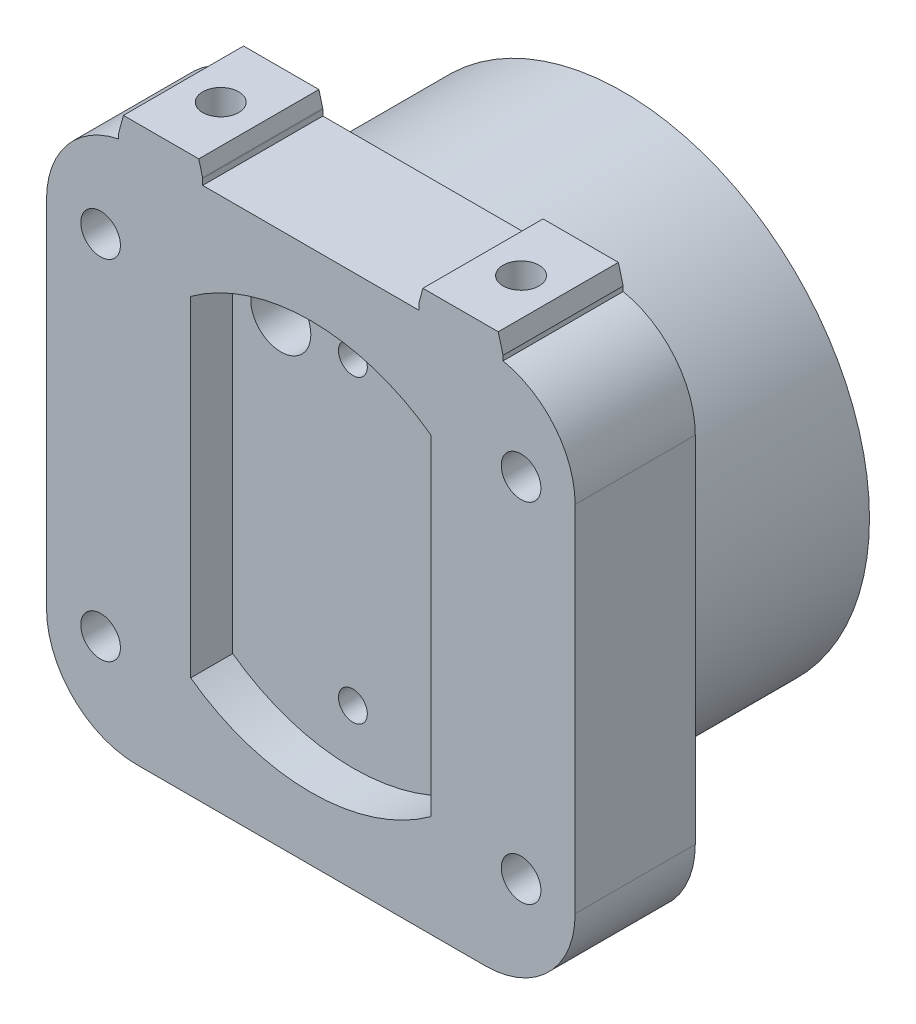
ISO-10303-21;
HEADER;
FILE_DESCRIPTION(('STEP AP214'),'2;1');
FILE_NAME('part.step','',(''),(''),'','','');
FILE_SCHEMA(('AUTOMOTIVE_DESIGN { 1 0 10303 214 1 1 1 1 }'));
ENDSEC;
DATA;
#1=APPLICATION_CONTEXT('core data for automotive mechanical design processes');
#2=APPLICATION_PROTOCOL_DEFINITION('international standard','automotive_design',2000,#1);
#3=PRODUCT_CONTEXT('',#1,'mechanical');
#4=PRODUCT('Part','Part','',(#3));
#5=PRODUCT_RELATED_PRODUCT_CATEGORY('part','',(#4));
#6=PRODUCT_DEFINITION_FORMATION('','',#4);
#7=PRODUCT_DEFINITION_CONTEXT('part definition',#1,'design');
#8=PRODUCT_DEFINITION('design','',#6,#7);
#9=PRODUCT_DEFINITION_SHAPE('','',#8);
#10=(LENGTH_UNIT() NAMED_UNIT(*) SI_UNIT(.MILLI.,.METRE.));
#11=(NAMED_UNIT(*) PLANE_ANGLE_UNIT() SI_UNIT($,.RADIAN.));
#12=(NAMED_UNIT(*) SI_UNIT($,.STERADIAN.) SOLID_ANGLE_UNIT());
#13=UNCERTAINTY_MEASURE_WITH_UNIT(LENGTH_MEASURE(1.E-05),#10,'distance_accuracy_value','');
#14=(GEOMETRIC_REPRESENTATION_CONTEXT(3) GLOBAL_UNCERTAINTY_ASSIGNED_CONTEXT((#13)) GLOBAL_UNIT_ASSIGNED_CONTEXT((#10,
#11,#12)) REPRESENTATION_CONTEXT('',''));
#15=CARTESIAN_POINT('',(0.,0.,0.));
#16=DIRECTION('',(0.,0.,1.));
#17=DIRECTION('',(1.,0.,0.));
#18=AXIS2_PLACEMENT_3D('',#15,#16,#17);
#19=CARTESIAN_POINT('',(-44.,44.5,20.));
#20=DIRECTION('',(0.,-1.,0.));
#21=DIRECTION('',(1.,0.,0.));
#22=AXIS2_PLACEMENT_3D('',#19,#20,#21);
#23=PLANE('',#22);
#24=DIRECTION('',(0.,0.,-1.));
#25=VECTOR('',#24,1.);
#26=CARTESIAN_POINT('',(-18.,44.5,20.));
#27=LINE('',#26,#25);
#28=CARTESIAN_POINT('',(-18.,44.5,20.));
#29=VERTEX_POINT('',#28);
#30=CARTESIAN_POINT('',(-18.,44.5,0.));
#31=VERTEX_POINT('',#30);
#32=EDGE_CURVE('E525',#29,#31,#27,.T.);
#33=ORIENTED_EDGE('',*,*,#32,.F.);
#34=DIRECTION('',(-1.,0.,0.));
#35=VECTOR('',#34,1.);
#36=CARTESIAN_POINT('',(-44.,44.5,20.));
#37=LINE('',#36,#35);
#38=CARTESIAN_POINT('',(18.,44.5,20.));
#39=VERTEX_POINT('',#38);
#40=EDGE_CURVE('E528',#39,#29,#37,.T.);
#41=ORIENTED_EDGE('',*,*,#40,.F.);
#42=DIRECTION('',(0.,0.,1.));
#43=VECTOR('',#42,1.);
#44=CARTESIAN_POINT('',(18.,44.5,20.));
#45=LINE('',#44,#43);
#46=CARTESIAN_POINT('',(18.,44.5,0.));
#47=VERTEX_POINT('',#46);
#48=EDGE_CURVE('E261',#47,#39,#45,.T.);
#49=ORIENTED_EDGE('',*,*,#48,.F.);
#50=DIRECTION('',(-1.,0.,0.));
#51=VECTOR('',#50,1.);
#52=CARTESIAN_POINT('',(-44.,44.5,0.));
#53=LINE('',#52,#51);
#54=EDGE_CURVE('E530',#47,#31,#53,.T.);
#55=ORIENTED_EDGE('',*,*,#54,.T.);
#56=EDGE_LOOP('',(#33,#41,#49,#55));
#57=FACE_BOUND('',#56,.T.);
#58=ADVANCED_FACE('F17',(#57),#23,.F.);
#59=CARTESIAN_POINT('',(-29.,29.5,20.));
#60=DIRECTION('',(0.,0.,-1.));
#61=DIRECTION('',(-1.,0.,0.));
#62=AXIS2_PLACEMENT_3D('',#59,#60,#61);
#63=CYLINDRICAL_SURFACE('',#62,15.);
#64=CARTESIAN_POINT('',(-29.,29.5,20.));
#65=DIRECTION('',(0.,0.,1.));
#66=DIRECTION('',(1.,0.,0.));
#67=AXIS2_PLACEMENT_3D('',#64,#65,#66);
#68=CIRCLE('',#67,15.);
#69=CARTESIAN_POINT('',(-32.,44.1969384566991,20.));
#70=VERTEX_POINT('',#69);
#71=CARTESIAN_POINT('',(-44.,29.5,20.));
#72=VERTEX_POINT('',#71);
#73=EDGE_CURVE('E267',#70,#72,#68,.T.);
#74=ORIENTED_EDGE('',*,*,#73,.F.);
#75=DIRECTION('',(0.,0.,-1.));
#76=VECTOR('',#75,1.);
#77=CARTESIAN_POINT('',(-32.,44.1969384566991,20.));
#78=LINE('',#77,#76);
#79=CARTESIAN_POINT('',(-32.,44.1969384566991,0.));
#80=VERTEX_POINT('',#79);
#81=EDGE_CURVE('E279',#70,#80,#78,.T.);
#82=ORIENTED_EDGE('',*,*,#81,.T.);
#83=CARTESIAN_POINT('',(-29.,29.5,0.));
#84=DIRECTION('',(0.,0.,1.));
#85=DIRECTION('',(1.,0.,0.));
#86=AXIS2_PLACEMENT_3D('',#83,#84,#85);
#87=CIRCLE('',#86,15.);
#88=CARTESIAN_POINT('',(-44.,29.5,0.));
#89=VERTEX_POINT('',#88);
#90=EDGE_CURVE('E264',#89,#80,#87,.F.);
#91=ORIENTED_EDGE('',*,*,#90,.F.);
#92=DIRECTION('',(0.,0.,-1.));
#93=VECTOR('',#92,1.);
#94=CARTESIAN_POINT('',(-44.,29.5,20.));
#95=LINE('',#94,#93);
#96=EDGE_CURVE('E252',#72,#89,#95,.T.);
#97=ORIENTED_EDGE('',*,*,#96,.F.);
#98=EDGE_LOOP('',(#74,#82,#91,#97));
#99=FACE_BOUND('',#98,.T.);
#100=ADVANCED_FACE('F409',(#99),#63,.T.);
#101=CARTESIAN_POINT('',(29.,29.5,20.));
#102=DIRECTION('',(0.,0.,-1.));
#103=DIRECTION('',(-1.,0.,0.));
#104=AXIS2_PLACEMENT_3D('',#101,#102,#103);
#105=CYLINDRICAL_SURFACE('',#104,15.);
#106=CARTESIAN_POINT('',(29.,29.5,0.));
#107=DIRECTION('',(0.,0.,1.));
#108=DIRECTION('',(1.,0.,0.));
#109=AXIS2_PLACEMENT_3D('',#106,#107,#108);
#110=CIRCLE('',#109,15.);
#111=CARTESIAN_POINT('',(32.,44.1969384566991,0.));
#112=VERTEX_POINT('',#111);
#113=CARTESIAN_POINT('',(44.,29.5,0.));
#114=VERTEX_POINT('',#113);
#115=EDGE_CURVE('E269',#112,#114,#110,.F.);
#116=ORIENTED_EDGE('',*,*,#115,.F.);
#117=DIRECTION('',(0.,0.,-1.));
#118=VECTOR('',#117,1.);
#119=CARTESIAN_POINT('',(32.,44.1969384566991,20.));
#120=LINE('',#119,#118);
#121=CARTESIAN_POINT('',(32.,44.1969384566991,20.));
#122=VERTEX_POINT('',#121);
#123=EDGE_CURVE('E276',#112,#122,#120,.F.);
#124=ORIENTED_EDGE('',*,*,#123,.T.);
#125=CARTESIAN_POINT('',(29.,29.5,20.));
#126=DIRECTION('',(0.,0.,1.));
#127=DIRECTION('',(1.,0.,0.));
#128=AXIS2_PLACEMENT_3D('',#125,#126,#127);
#129=CIRCLE('',#128,15.);
#130=CARTESIAN_POINT('',(44.,29.5,20.));
#131=VERTEX_POINT('',#130);
#132=EDGE_CURVE('E273',#131,#122,#129,.T.);
#133=ORIENTED_EDGE('',*,*,#132,.F.);
#134=DIRECTION('',(0.,0.,-1.));
#135=VECTOR('',#134,1.);
#136=CARTESIAN_POINT('',(44.,29.5,20.));
#137=LINE('',#136,#135);
#138=EDGE_CURVE('E271',#114,#131,#137,.F.);
#139=ORIENTED_EDGE('',*,*,#138,.F.);
#140=EDGE_LOOP('',(#116,#124,#133,#139));
#141=FACE_BOUND('',#140,.T.);
#142=ADVANCED_FACE('F405',(#141),#105,.T.);
#143=CARTESIAN_POINT('',(0.,0.,0.));
#144=DIRECTION('',(0.,0.,-1.));
#145=DIRECTION('',(-1.,0.,0.));
#146=AXIS2_PLACEMENT_3D('',#143,#144,#145);
#147=PLANE('',#146);
#148=CARTESIAN_POINT('',(0.,-25.,0.));
#149=DIRECTION('',(0.,0.,-1.));
#150=DIRECTION('',(-1.,0.,0.));
#151=AXIS2_PLACEMENT_3D('',#148,#149,#150);
#152=CIRCLE('',#151,2.4);
#153=CARTESIAN_POINT('',(-2.4,-25.,0.));
#154=VERTEX_POINT('',#153);
#155=EDGE_CURVE('E257',#154,#154,#152,.T.);
#156=ORIENTED_EDGE('',*,*,#155,.F.);
#157=EDGE_LOOP('',(#156));
#158=FACE_BOUND('',#157,.T.);
#159=CARTESIAN_POINT('',(0.,25.,0.));
#160=DIRECTION('',(0.,0.,-1.));
#161=DIRECTION('',(-1.,0.,0.));
#162=AXIS2_PLACEMENT_3D('',#159,#160,#161);
#163=CIRCLE('',#162,2.4);
#164=CARTESIAN_POINT('',(-2.4,25.,0.));
#165=VERTEX_POINT('',#164);
#166=EDGE_CURVE('E256',#165,#165,#163,.T.);
#167=ORIENTED_EDGE('',*,*,#166,.F.);
#168=EDGE_LOOP('',(#167));
#169=FACE_BOUND('',#168,.T.);
#170=CARTESIAN_POINT('',(-12.,25.,0.));
#171=DIRECTION('',(0.,0.,-1.));
#172=DIRECTION('',(-1.,0.,0.));
#173=AXIS2_PLACEMENT_3D('',#170,#171,#172);
#174=CIRCLE('',#173,5.);
#175=CARTESIAN_POINT('',(-17.,25.,0.));
#176=VERTEX_POINT('',#175);
#177=EDGE_CURVE('E629',#176,#176,#174,.T.);
#178=ORIENTED_EDGE('',*,*,#177,.F.);
#179=EDGE_LOOP('',(#178));
#180=FACE_BOUND('',#179,.T.);
#181=CARTESIAN_POINT('',(0.,0.,0.));
#182=DIRECTION('',(0.,0.,-1.));
#183=DIRECTION('',(-1.,0.,0.));
#184=AXIS2_PLACEMENT_3D('',#181,#182,#183);
#185=CIRCLE('',#184,20.9163311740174);
#186=CARTESIAN_POINT('',(-20.9163311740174,0.,0.));
#187=VERTEX_POINT('',#186);
#188=EDGE_CURVE('E249',#187,#187,#185,.F.);
#189=ORIENTED_EDGE('',*,*,#188,.T.);
#190=EDGE_LOOP('',(#189));
#191=FACE_BOUND('',#190,.T.);
#192=CARTESIAN_POINT('',(0.,0.,0.));
#193=DIRECTION('',(0.,0.,-1.));
#194=DIRECTION('',(-1.,0.,0.));
#195=AXIS2_PLACEMENT_3D('',#192,#193,#194);
#196=CIRCLE('',#195,35.284031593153);
#197=CARTESIAN_POINT('',(-35.284031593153,0.,0.));
#198=VERTEX_POINT('',#197);
#199=EDGE_CURVE('E240',#198,#198,#196,.T.);
#200=ORIENTED_EDGE('',*,*,#199,.T.);
#201=EDGE_LOOP('',(#200));
#202=FACE_BOUND('',#201,.T.);
#203=ADVANCED_FACE('F408',(#158,#169,#180,#191,#202),#147,.T.);
#204=CARTESIAN_POINT('',(44.,44.5,0.));
#205=DIRECTION('',(0.,0.,1.));
#206=DIRECTION('',(1.,0.,0.));
#207=AXIS2_PLACEMENT_3D('',#204,#205,#206);
#208=PLANE('',#207);
#209=DIRECTION('',(0.,-1.,0.));
#210=VECTOR('',#209,1.);
#211=CARTESIAN_POINT('',(18.,48.,0.));
#212=LINE('',#211,#210);
#213=CARTESIAN_POINT('',(18.,45.4841737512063,0.));
#214=VERTEX_POINT('',#213);
#215=EDGE_CURVE('E593',#214,#47,#212,.T.);
#216=ORIENTED_EDGE('',*,*,#215,.F.);
#217=CARTESIAN_POINT('',(18.5,45.4841737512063,0.));
#218=DIRECTION('',(0.,0.,1.));
#219=DIRECTION('',(1.,0.,0.));
#220=AXIS2_PLACEMENT_3D('',#217,#218,#219);
#221=CIRCLE('',#220,0.5);
#222=CARTESIAN_POINT('',(18.0170370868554,45.6135832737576,0.));
#223=VERTEX_POINT('',#222);
#224=EDGE_CURVE('E321',#214,#223,#221,.F.);
#225=ORIENTED_EDGE('',*,*,#224,.T.);
#226=DIRECTION('',(-0.258819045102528,-0.965925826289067,0.));
#227=VECTOR('',#226,1.);
#228=CARTESIAN_POINT('',(18.6564755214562,48.,0.));
#229=LINE('',#228,#227);
#230=CARTESIAN_POINT('',(18.6564755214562,48.,0.));
#231=VERTEX_POINT('',#230);
#232=EDGE_CURVE('E285',#223,#231,#229,.F.);
#233=ORIENTED_EDGE('',*,*,#232,.T.);
#234=DIRECTION('',(-1.,0.,0.));
#235=VECTOR('',#234,1.);
#236=CARTESIAN_POINT('',(32.,48.,0.));
#237=LINE('',#236,#235);
#238=CARTESIAN_POINT('',(31.1961524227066,48.,0.));
#239=VERTEX_POINT('',#238);
#240=EDGE_CURVE('E532',#239,#231,#237,.T.);
#241=ORIENTED_EDGE('',*,*,#240,.F.);
#242=DIRECTION('',(-0.258819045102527,0.965925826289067,0.));
#243=VECTOR('',#242,1.);
#244=CARTESIAN_POINT('',(31.1961524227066,48.,0.));
#245=LINE('',#244,#243);
#246=CARTESIAN_POINT('',(32.,45.,0.));
#247=VERTEX_POINT('',#246);
#248=EDGE_CURVE('E307',#239,#247,#245,.F.);
#249=ORIENTED_EDGE('',*,*,#248,.T.);
#250=DIRECTION('',(0.,-1.,0.));
#251=VECTOR('',#250,1.);
#252=CARTESIAN_POINT('',(32.,48.,0.));
#253=LINE('',#252,#251);
#254=EDGE_CURVE('E595',#247,#112,#253,.T.);
#255=ORIENTED_EDGE('',*,*,#254,.T.);
#256=ORIENTED_EDGE('',*,*,#115,.T.);
#257=DIRECTION('',(0.,1.,0.));
#258=VECTOR('',#257,1.);
#259=CARTESIAN_POINT('',(44.,-44.5,0.));
#260=LINE('',#259,#258);
#261=CARTESIAN_POINT('',(44.,-29.5,0.));
#262=VERTEX_POINT('',#261);
#263=EDGE_CURVE('E543',#262,#114,#260,.T.);
#264=ORIENTED_EDGE('',*,*,#263,.F.);
#265=CARTESIAN_POINT('',(29.,-29.5,0.));
#266=DIRECTION('',(0.,0.,1.));
#267=DIRECTION('',(1.,0.,0.));
#268=AXIS2_PLACEMENT_3D('',#265,#266,#267);
#269=CIRCLE('',#268,15.);
#270=CARTESIAN_POINT('',(29.,-44.5,0.));
#271=VERTEX_POINT('',#270);
#272=EDGE_CURVE('E220',#262,#271,#269,.F.);
#273=ORIENTED_EDGE('',*,*,#272,.T.);
#274=DIRECTION('',(1.,0.,0.));
#275=VECTOR('',#274,1.);
#276=CARTESIAN_POINT('',(-44.,-44.5,0.));
#277=LINE('',#276,#275);
#278=CARTESIAN_POINT('',(-29.,-44.5,0.));
#279=VERTEX_POINT('',#278);
#280=EDGE_CURVE('E547',#279,#271,#277,.T.);
#281=ORIENTED_EDGE('',*,*,#280,.F.);
#282=CARTESIAN_POINT('',(-29.,-29.5,0.));
#283=DIRECTION('',(0.,0.,1.));
#284=DIRECTION('',(1.,0.,0.));
#285=AXIS2_PLACEMENT_3D('',#282,#283,#284);
#286=CIRCLE('',#285,15.);
#287=CARTESIAN_POINT('',(-44.,-29.5,0.));
#288=VERTEX_POINT('',#287);
#289=EDGE_CURVE('E222',#279,#288,#286,.F.);
#290=ORIENTED_EDGE('',*,*,#289,.T.);
#291=DIRECTION('',(0.,-1.,0.));
#292=VECTOR('',#291,1.);
#293=CARTESIAN_POINT('',(-44.,-44.5,0.));
#294=LINE('',#293,#292);
#295=EDGE_CURVE('E683',#89,#288,#294,.T.);
#296=ORIENTED_EDGE('',*,*,#295,.F.);
#297=ORIENTED_EDGE('',*,*,#90,.T.);
#298=DIRECTION('',(0.,-1.,0.));
#299=VECTOR('',#298,1.);
#300=CARTESIAN_POINT('',(-32.,48.,0.));
#301=LINE('',#300,#299);
#302=CARTESIAN_POINT('',(-32.,45.,0.));
#303=VERTEX_POINT('',#302);
#304=EDGE_CURVE('E533',#303,#80,#301,.T.);
#305=ORIENTED_EDGE('',*,*,#304,.F.);
#306=DIRECTION('',(-0.258819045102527,-0.965925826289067,0.));
#307=VECTOR('',#306,1.);
#308=CARTESIAN_POINT('',(-31.1961524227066,48.,0.));
#309=LINE('',#308,#307);
#310=CARTESIAN_POINT('',(-31.1961524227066,48.,0.));
#311=VERTEX_POINT('',#310);
#312=EDGE_CURVE('E309',#303,#311,#309,.F.);
#313=ORIENTED_EDGE('',*,*,#312,.T.);
#314=DIRECTION('',(-1.,0.,0.));
#315=VECTOR('',#314,1.);
#316=CARTESIAN_POINT('',(-32.,48.,0.));
#317=LINE('',#316,#315);
#318=CARTESIAN_POINT('',(-18.6564755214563,48.,0.));
#319=VERTEX_POINT('',#318);
#320=EDGE_CURVE('E573',#319,#311,#317,.T.);
#321=ORIENTED_EDGE('',*,*,#320,.F.);
#322=DIRECTION('',(-0.258819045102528,0.965925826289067,0.));
#323=VECTOR('',#322,1.);
#324=CARTESIAN_POINT('',(-18.6564755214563,48.,0.));
#325=LINE('',#324,#323);
#326=CARTESIAN_POINT('',(-18.0170370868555,45.6135832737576,0.));
#327=VERTEX_POINT('',#326);
#328=EDGE_CURVE('E287',#319,#327,#325,.F.);
#329=ORIENTED_EDGE('',*,*,#328,.T.);
#330=CARTESIAN_POINT('',(-18.5,45.4841737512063,0.));
#331=DIRECTION('',(0.,0.,1.));
#332=DIRECTION('',(1.,0.,0.));
#333=AXIS2_PLACEMENT_3D('',#330,#331,#332);
#334=CIRCLE('',#333,0.5);
#335=CARTESIAN_POINT('',(-18.,45.4841737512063,0.));
#336=VERTEX_POINT('',#335);
#337=EDGE_CURVE('E319',#327,#336,#334,.F.);
#338=ORIENTED_EDGE('',*,*,#337,.T.);
#339=DIRECTION('',(0.,-1.,0.));
#340=VECTOR('',#339,1.);
#341=CARTESIAN_POINT('',(-18.,48.,0.));
#342=LINE('',#341,#340);
#343=EDGE_CURVE('E579',#336,#31,#342,.T.);
#344=ORIENTED_EDGE('',*,*,#343,.T.);
#345=ORIENTED_EDGE('',*,*,#54,.F.);
#346=EDGE_LOOP('',(#216,#225,#233,#241,#249,#255,#256,#264,#273,#281,#290,#296,#297,#305,#313,
#321,#329,#338,#344,#345));
#347=FACE_BOUND('',#346,.T.);
#348=CARTESIAN_POINT('',(35.,-29.,0.));
#349=DIRECTION('',(0.,0.,1.));
#350=DIRECTION('',(1.,0.,0.));
#351=AXIS2_PLACEMENT_3D('',#348,#349,#350);
#352=CIRCLE('',#351,3.3);
#353=CARTESIAN_POINT('',(38.3,-29.,0.));
#354=VERTEX_POINT('',#353);
#355=EDGE_CURVE('E605',#354,#354,#352,.T.);
#356=ORIENTED_EDGE('',*,*,#355,.T.);
#357=EDGE_LOOP('',(#356));
#358=FACE_BOUND('',#357,.T.);
#359=CARTESIAN_POINT('',(-35.,-29.,0.));
#360=DIRECTION('',(0.,0.,1.));
#361=DIRECTION('',(1.,0.,0.));
#362=AXIS2_PLACEMENT_3D('',#359,#360,#361);
#363=CIRCLE('',#362,3.3);
#364=CARTESIAN_POINT('',(-31.7,-29.,0.));
#365=VERTEX_POINT('',#364);
#366=EDGE_CURVE('E611',#365,#365,#363,.T.);
#367=ORIENTED_EDGE('',*,*,#366,.T.);
#368=EDGE_LOOP('',(#367));
#369=FACE_BOUND('',#368,.T.);
#370=CARTESIAN_POINT('',(35.,29.,0.));
#371=DIRECTION('',(0.,0.,1.));
#372=DIRECTION('',(1.,0.,0.));
#373=AXIS2_PLACEMENT_3D('',#370,#371,#372);
#374=CIRCLE('',#373,3.3);
#375=CARTESIAN_POINT('',(38.3,29.,0.));
#376=VERTEX_POINT('',#375);
#377=EDGE_CURVE('E617',#376,#376,#374,.T.);
#378=ORIENTED_EDGE('',*,*,#377,.T.);
#379=EDGE_LOOP('',(#378));
#380=FACE_BOUND('',#379,.T.);
#381=CARTESIAN_POINT('',(-35.,29.,0.));
#382=DIRECTION('',(0.,0.,1.));
#383=DIRECTION('',(1.,0.,0.));
#384=AXIS2_PLACEMENT_3D('',#381,#382,#383);
#385=CIRCLE('',#384,3.3);
#386=CARTESIAN_POINT('',(-31.7,29.,0.));
#387=VERTEX_POINT('',#386);
#388=EDGE_CURVE('E623',#387,#387,#385,.T.);
#389=ORIENTED_EDGE('',*,*,#388,.T.);
#390=EDGE_LOOP('',(#389));
#391=FACE_BOUND('',#390,.T.);
#392=CARTESIAN_POINT('',(0.,0.,0.));
#393=DIRECTION('',(0.,0.,1.));
#394=DIRECTION('',(1.,0.,0.));
#395=AXIS2_PLACEMENT_3D('',#392,#393,#394);
#396=CIRCLE('',#395,41.);
#397=CARTESIAN_POINT('',(41.,0.,0.));
#398=VERTEX_POINT('',#397);
#399=EDGE_CURVE('E234',#398,#398,#396,.F.);
#400=ORIENTED_EDGE('',*,*,#399,.F.);
#401=EDGE_LOOP('',(#400));
#402=FACE_BOUND('',#401,.T.);
#403=ADVANCED_FACE('F476',(#347,#358,#369,#380,#391,#402),#208,.F.);
#404=CARTESIAN_POINT('',(-44.,-44.5,20.));
#405=DIRECTION('',(1.,0.,0.));
#406=DIRECTION('',(0.,1.,0.));
#407=AXIS2_PLACEMENT_3D('',#404,#405,#406);
#408=PLANE('',#407);
#409=DIRECTION('',(0.,-1.,0.));
#410=VECTOR('',#409,1.);
#411=CARTESIAN_POINT('',(-44.,-44.5,20.));
#412=LINE('',#411,#410);
#413=CARTESIAN_POINT('',(-44.,-29.5,20.));
#414=VERTEX_POINT('',#413);
#415=EDGE_CURVE('E542',#72,#414,#412,.T.);
#416=ORIENTED_EDGE('',*,*,#415,.F.);
#417=ORIENTED_EDGE('',*,*,#96,.T.);
#418=ORIENTED_EDGE('',*,*,#295,.T.);
#419=DIRECTION('',(0.,0.,-1.));
#420=VECTOR('',#419,1.);
#421=CARTESIAN_POINT('',(-44.,-29.5,20.));
#422=LINE('',#421,#420);
#423=EDGE_CURVE('E225',#288,#414,#422,.F.);
#424=ORIENTED_EDGE('',*,*,#423,.T.);
#425=EDGE_LOOP('',(#416,#417,#418,#424));
#426=FACE_BOUND('',#425,.T.);
#427=ADVANCED_FACE('F726',(#426),#408,.F.);
#428=CARTESIAN_POINT('',(-44.,-44.5,20.));
#429=DIRECTION('',(0.,1.,0.));
#430=DIRECTION('',(-1.,0.,0.));
#431=AXIS2_PLACEMENT_3D('',#428,#429,#430);
#432=PLANE('',#431);
#433=DIRECTION('',(0.,0.,-1.));
#434=VECTOR('',#433,1.);
#435=CARTESIAN_POINT('',(29.,-44.5,20.));
#436=LINE('',#435,#434);
#437=CARTESIAN_POINT('',(29.,-44.5,4.87652461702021));
#438=VERTEX_POINT('',#437);
#439=EDGE_CURVE('E202',#271,#438,#436,.F.);
#440=ORIENTED_EDGE('',*,*,#439,.T.);
#441=CARTESIAN_POINT('',(25.,-44.5,10.));
#442=DIRECTION('',(0.,-1.,0.));
#443=DIRECTION('',(0.,0.,-1.));
#444=AXIS2_PLACEMENT_3D('',#441,#442,#443);
#445=CIRCLE('',#444,6.5);
#446=CARTESIAN_POINT('',(29.,-44.5,15.1234753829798));
#447=VERTEX_POINT('',#446);
#448=EDGE_CURVE('E34',#447,#438,#445,.T.);
#449=ORIENTED_EDGE('',*,*,#448,.F.);
#450=CARTESIAN_POINT('',(29.,-44.5,20.));
#451=VERTEX_POINT('',#450);
#452=EDGE_CURVE('E199',#447,#451,#436,.F.);
#453=ORIENTED_EDGE('',*,*,#452,.T.);
#454=DIRECTION('',(1.,0.,0.));
#455=VECTOR('',#454,1.);
#456=CARTESIAN_POINT('',(-44.,-44.5,20.));
#457=LINE('',#456,#455);
#458=CARTESIAN_POINT('',(-29.,-44.5,20.));
#459=VERTEX_POINT('',#458);
#460=EDGE_CURVE('E213',#459,#451,#457,.T.);
#461=ORIENTED_EDGE('',*,*,#460,.F.);
#462=DIRECTION('',(0.,0.,-1.));
#463=VECTOR('',#462,1.);
#464=CARTESIAN_POINT('',(-29.,-44.5,20.));
#465=LINE('',#464,#463);
#466=CARTESIAN_POINT('',(-29.,-44.5,15.1234753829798));
#467=VERTEX_POINT('',#466);
#468=EDGE_CURVE('E217',#459,#467,#465,.T.);
#469=ORIENTED_EDGE('',*,*,#468,.T.);
#470=CARTESIAN_POINT('',(-25.,-44.5,10.));
#471=DIRECTION('',(0.,-1.,0.));
#472=DIRECTION('',(0.,0.,-1.));
#473=AXIS2_PLACEMENT_3D('',#470,#471,#472);
#474=CIRCLE('',#473,6.5);
#475=CARTESIAN_POINT('',(-29.,-44.5,4.8765246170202));
#476=VERTEX_POINT('',#475);
#477=EDGE_CURVE('E41',#476,#467,#474,.T.);
#478=ORIENTED_EDGE('',*,*,#477,.F.);
#479=EDGE_CURVE('E211',#476,#279,#465,.T.);
#480=ORIENTED_EDGE('',*,*,#479,.T.);
#481=ORIENTED_EDGE('',*,*,#280,.T.);
#482=EDGE_LOOP('',(#440,#449,#453,#461,#469,#478,#480,#481));
#483=FACE_BOUND('',#482,.T.);
#484=ADVANCED_FACE('F197',(#483),#432,.F.);
#485=CARTESIAN_POINT('',(44.,-44.5,20.));
#486=DIRECTION('',(-1.,0.,0.));
#487=DIRECTION('',(0.,-1.,0.));
#488=AXIS2_PLACEMENT_3D('',#485,#486,#487);
#489=PLANE('',#488);
#490=ORIENTED_EDGE('',*,*,#263,.T.);
#491=ORIENTED_EDGE('',*,*,#138,.T.);
#492=DIRECTION('',(0.,1.,0.));
#493=VECTOR('',#492,1.);
#494=CARTESIAN_POINT('',(44.,-44.5,20.));
#495=LINE('',#494,#493);
#496=CARTESIAN_POINT('',(44.,-29.5,20.));
#497=VERTEX_POINT('',#496);
#498=EDGE_CURVE('E209',#497,#131,#495,.T.);
#499=ORIENTED_EDGE('',*,*,#498,.F.);
#500=DIRECTION('',(0.,0.,-1.));
#501=VECTOR('',#500,1.);
#502=CARTESIAN_POINT('',(44.,-29.5,20.));
#503=LINE('',#502,#501);
#504=EDGE_CURVE('E231',#497,#262,#503,.T.);
#505=ORIENTED_EDGE('',*,*,#504,.T.);
#506=EDGE_LOOP('',(#490,#491,#499,#505));
#507=FACE_BOUND('',#506,.T.);
#508=ADVANCED_FACE('F688',(#507),#489,.F.);
#509=CARTESIAN_POINT('',(44.,44.5,20.));
#510=DIRECTION('',(0.,0.,1.));
#511=DIRECTION('',(1.,0.,0.));
#512=AXIS2_PLACEMENT_3D('',#509,#510,#511);
#513=PLANE('',#512);
#514=DIRECTION('',(0.258819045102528,0.965925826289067,0.));
#515=VECTOR('',#514,1.);
#516=CARTESIAN_POINT('',(19.4791697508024,51.0703366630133,20.));
#517=LINE('',#516,#515);
#518=CARTESIAN_POINT('',(18.6564755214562,48.,20.));
#519=VERTEX_POINT('',#518);
#520=CARTESIAN_POINT('',(18.0170370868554,45.6135832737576,20.));
#521=VERTEX_POINT('',#520);
#522=EDGE_CURVE('E290',#519,#521,#517,.F.);
#523=ORIENTED_EDGE('',*,*,#522,.T.);
#524=CARTESIAN_POINT('',(18.5,45.4841737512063,20.));
#525=DIRECTION('',(0.,0.,1.));
#526=DIRECTION('',(1.,0.,0.));
#527=AXIS2_PLACEMENT_3D('',#524,#525,#526);
#528=CIRCLE('',#527,0.5);
#529=CARTESIAN_POINT('',(18.,45.4841737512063,20.));
#530=VERTEX_POINT('',#529);
#531=EDGE_CURVE('E327',#521,#530,#528,.T.);
#532=ORIENTED_EDGE('',*,*,#531,.T.);
#533=DIRECTION('',(0.,-1.,0.));
#534=VECTOR('',#533,1.);
#535=CARTESIAN_POINT('',(18.,48.,20.));
#536=LINE('',#535,#534);
#537=EDGE_CURVE('E540',#530,#39,#536,.T.);
#538=ORIENTED_EDGE('',*,*,#537,.T.);
#539=ORIENTED_EDGE('',*,*,#40,.T.);
#540=DIRECTION('',(0.,-1.,0.));
#541=VECTOR('',#540,1.);
#542=CARTESIAN_POINT('',(-18.,48.,20.));
#543=LINE('',#542,#541);
#544=CARTESIAN_POINT('',(-18.,45.4841737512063,20.));
#545=VERTEX_POINT('',#544);
#546=EDGE_CURVE('E538',#545,#29,#543,.T.);
#547=ORIENTED_EDGE('',*,*,#546,.F.);
#548=CARTESIAN_POINT('',(-18.5,45.4841737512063,20.));
#549=DIRECTION('',(0.,0.,1.));
#550=DIRECTION('',(1.,0.,0.));
#551=AXIS2_PLACEMENT_3D('',#548,#549,#550);
#552=CIRCLE('',#551,0.5);
#553=CARTESIAN_POINT('',(-18.0170370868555,45.6135832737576,20.));
#554=VERTEX_POINT('',#553);
#555=EDGE_CURVE('E325',#545,#554,#552,.T.);
#556=ORIENTED_EDGE('',*,*,#555,.T.);
#557=DIRECTION('',(0.258819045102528,-0.965925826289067,0.));
#558=VECTOR('',#557,1.);
#559=CARTESIAN_POINT('',(-13.5842875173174,29.0703366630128,20.));
#560=LINE('',#559,#558);
#561=CARTESIAN_POINT('',(-18.6564755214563,48.,20.));
#562=VERTEX_POINT('',#561);
#563=EDGE_CURVE('E293',#554,#562,#560,.F.);
#564=ORIENTED_EDGE('',*,*,#563,.T.);
#565=DIRECTION('',(1.,0.,0.));
#566=VECTOR('',#565,1.);
#567=CARTESIAN_POINT('',(-32.,48.,20.));
#568=LINE('',#567,#566);
#569=CARTESIAN_POINT('',(-31.1961524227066,48.,20.));
#570=VERTEX_POINT('',#569);
#571=EDGE_CURVE('E576',#570,#562,#568,.T.);
#572=ORIENTED_EDGE('',*,*,#571,.F.);
#573=DIRECTION('',(0.258819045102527,0.965925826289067,0.));
#574=VECTOR('',#573,1.);
#575=CARTESIAN_POINT('',(-27.0339653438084,63.5334936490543,20.));
#576=LINE('',#575,#574);
#577=CARTESIAN_POINT('',(-32.,45.,20.));
#578=VERTEX_POINT('',#577);
#579=EDGE_CURVE('E303',#570,#578,#576,.F.);
#580=ORIENTED_EDGE('',*,*,#579,.T.);
#581=DIRECTION('',(0.,-1.,0.));
#582=VECTOR('',#581,1.);
#583=CARTESIAN_POINT('',(-32.,48.,20.));
#584=LINE('',#583,#582);
#585=EDGE_CURVE('E582',#578,#70,#584,.T.);
#586=ORIENTED_EDGE('',*,*,#585,.T.);
#587=ORIENTED_EDGE('',*,*,#73,.T.);
#588=ORIENTED_EDGE('',*,*,#415,.T.);
#589=CARTESIAN_POINT('',(-29.,-29.5,20.));
#590=DIRECTION('',(0.,0.,1.));
#591=DIRECTION('',(1.,0.,0.));
#592=AXIS2_PLACEMENT_3D('',#589,#590,#591);
#593=CIRCLE('',#592,15.);
#594=EDGE_CURVE('E229',#414,#459,#593,.T.);
#595=ORIENTED_EDGE('',*,*,#594,.T.);
#596=ORIENTED_EDGE('',*,*,#460,.T.);
#597=CARTESIAN_POINT('',(29.,-29.5,20.));
#598=DIRECTION('',(0.,0.,1.));
#599=DIRECTION('',(1.,0.,0.));
#600=AXIS2_PLACEMENT_3D('',#597,#598,#599);
#601=CIRCLE('',#600,15.);
#602=EDGE_CURVE('E208',#451,#497,#601,.T.);
#603=ORIENTED_EDGE('',*,*,#602,.T.);
#604=ORIENTED_EDGE('',*,*,#498,.T.);
#605=ORIENTED_EDGE('',*,*,#132,.T.);
#606=DIRECTION('',(0.,-1.,0.));
#607=VECTOR('',#606,1.);
#608=CARTESIAN_POINT('',(32.,48.,20.));
#609=LINE('',#608,#607);
#610=CARTESIAN_POINT('',(32.,45.,20.));
#611=VERTEX_POINT('',#610);
#612=EDGE_CURVE('E590',#611,#122,#609,.T.);
#613=ORIENTED_EDGE('',*,*,#612,.F.);
#614=DIRECTION('',(0.258819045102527,-0.965925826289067,0.));
#615=VECTOR('',#614,1.);
#616=CARTESIAN_POINT('',(32.9288475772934,41.5334936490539,20.));
#617=LINE('',#616,#615);
#618=CARTESIAN_POINT('',(31.1961524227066,48.,20.));
#619=VERTEX_POINT('',#618);
#620=EDGE_CURVE('E301',#611,#619,#617,.F.);
#621=ORIENTED_EDGE('',*,*,#620,.T.);
#622=DIRECTION('',(1.,0.,0.));
#623=VECTOR('',#622,1.);
#624=CARTESIAN_POINT('',(32.,48.,20.));
#625=LINE('',#624,#623);
#626=EDGE_CURVE('E587',#519,#619,#625,.T.);
#627=ORIENTED_EDGE('',*,*,#626,.F.);
#628=EDGE_LOOP('',(#523,#532,#538,#539,#547,#556,#564,#572,#580,#586,#587,#588,#595,#596,#603,
#604,#605,#613,#621,#627));
#629=FACE_BOUND('',#628,.T.);
#630=CARTESIAN_POINT('',(35.,-29.,20.));
#631=DIRECTION('',(0.,0.,1.));
#632=DIRECTION('',(1.,0.,0.));
#633=AXIS2_PLACEMENT_3D('',#630,#631,#632);
#634=CIRCLE('',#633,3.3);
#635=CARTESIAN_POINT('',(38.3,-29.,20.));
#636=VERTEX_POINT('',#635);
#637=EDGE_CURVE('E602',#636,#636,#634,.T.);
#638=ORIENTED_EDGE('',*,*,#637,.F.);
#639=EDGE_LOOP('',(#638));
#640=FACE_BOUND('',#639,.T.);
#641=CARTESIAN_POINT('',(-35.,-29.,20.));
#642=DIRECTION('',(0.,0.,1.));
#643=DIRECTION('',(-1.,0.,0.));
#644=AXIS2_PLACEMENT_3D('',#641,#642,#643);
#645=CIRCLE('',#644,3.3);
#646=CARTESIAN_POINT('',(-38.3,-29.,20.));
#647=VERTEX_POINT('',#646);
#648=EDGE_CURVE('E608',#647,#647,#645,.T.);
#649=ORIENTED_EDGE('',*,*,#648,.F.);
#650=EDGE_LOOP('',(#649));
#651=FACE_BOUND('',#650,.T.);
#652=CARTESIAN_POINT('',(35.,29.,20.));
#653=DIRECTION('',(0.,0.,1.));
#654=DIRECTION('',(-1.,0.,0.));
#655=AXIS2_PLACEMENT_3D('',#652,#653,#654);
#656=CIRCLE('',#655,3.3);
#657=CARTESIAN_POINT('',(31.7,29.,20.));
#658=VERTEX_POINT('',#657);
#659=EDGE_CURVE('E614',#658,#658,#656,.T.);
#660=ORIENTED_EDGE('',*,*,#659,.F.);
#661=EDGE_LOOP('',(#660));
#662=FACE_BOUND('',#661,.T.);
#663=CARTESIAN_POINT('',(-35.,29.,20.));
#664=DIRECTION('',(0.,0.,1.));
#665=DIRECTION('',(1.,0.,0.));
#666=AXIS2_PLACEMENT_3D('',#663,#664,#665);
#667=CIRCLE('',#666,3.3);
#668=CARTESIAN_POINT('',(-31.7,29.,20.));
#669=VERTEX_POINT('',#668);
#670=EDGE_CURVE('E620',#669,#669,#667,.T.);
#671=ORIENTED_EDGE('',*,*,#670,.F.);
#672=EDGE_LOOP('',(#671));
#673=FACE_BOUND('',#672,.T.);
#674=CARTESIAN_POINT('',(0.,0.,20.));
#675=DIRECTION('',(0.,0.,1.));
#676=DIRECTION('',(-1.,0.,0.));
#677=AXIS2_PLACEMENT_3D('',#674,#675,#676);
#678=CIRCLE('',#677,34.0036762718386);
#679=CARTESIAN_POINT('',(20.,27.5,20.));
#680=VERTEX_POINT('',#679);
#681=CARTESIAN_POINT('',(-20.,27.5,20.));
#682=VERTEX_POINT('',#681);
#683=EDGE_CURVE('E650',#680,#682,#678,.T.);
#684=ORIENTED_EDGE('',*,*,#683,.F.);
#685=DIRECTION('',(0.,1.,0.));
#686=VECTOR('',#685,1.);
#687=CARTESIAN_POINT('',(20.,-27.5,20.));
#688=LINE('',#687,#686);
#689=CARTESIAN_POINT('',(20.,-27.5,20.));
#690=VERTEX_POINT('',#689);
#691=EDGE_CURVE('E658',#690,#680,#688,.T.);
#692=ORIENTED_EDGE('',*,*,#691,.F.);
#693=CARTESIAN_POINT('',(0.,0.,20.));
#694=DIRECTION('',(0.,0.,1.));
#695=DIRECTION('',(1.,0.,0.));
#696=AXIS2_PLACEMENT_3D('',#693,#694,#695);
#697=CIRCLE('',#696,34.0036762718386);
#698=CARTESIAN_POINT('',(-20.,-27.5,20.));
#699=VERTEX_POINT('',#698);
#700=EDGE_CURVE('E655',#699,#690,#697,.T.);
#701=ORIENTED_EDGE('',*,*,#700,.F.);
#702=DIRECTION('',(0.,-1.,0.));
#703=VECTOR('',#702,1.);
#704=CARTESIAN_POINT('',(-20.,-27.5,20.));
#705=LINE('',#704,#703);
#706=EDGE_CURVE('E652',#682,#699,#705,.T.);
#707=ORIENTED_EDGE('',*,*,#706,.F.);
#708=EDGE_LOOP('',(#684,#692,#701,#707));
#709=FACE_BOUND('',#708,.T.);
#710=ADVANCED_FACE('F514',(#629,#640,#651,#662,#673,#709),#513,.T.);
#711=CARTESIAN_POINT('',(-29.,-29.5,20.));
#712=DIRECTION('',(0.,0.,-1.));
#713=DIRECTION('',(-1.,0.,0.));
#714=AXIS2_PLACEMENT_3D('',#711,#712,#713);
#715=CYLINDRICAL_SURFACE('',#714,15.);
#716=CARTESIAN_POINT('',(-29.,-44.5,15.1234753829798));
#717=CARTESIAN_POINT('',(-29.1434693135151,-44.5000055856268,15.0114928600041));
#718=CARTESIAN_POINT('',(-29.282192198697,-44.4979415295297,14.8934659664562));
#719=CARTESIAN_POINT('',(-29.5491865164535,-44.490536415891,14.6462798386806));
#720=CARTESIAN_POINT('',(-29.6774604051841,-44.4851961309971,14.5171232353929));
#721=CARTESIAN_POINT('',(-29.9225604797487,-44.472105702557,14.2486966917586));
#722=CARTESIAN_POINT('',(-30.0393964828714,-44.4643576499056,14.1094356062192));
#723=CARTESIAN_POINT('',(-30.260964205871,-44.4473180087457,13.8216784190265));
#724=CARTESIAN_POINT('',(-30.3656954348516,-44.4380263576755,13.6731819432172));
#725=CARTESIAN_POINT('',(-30.5623065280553,-44.41874514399,13.3680376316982));
#726=CARTESIAN_POINT('',(-30.6541913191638,-44.4087558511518,13.2113929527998));
#727=CARTESIAN_POINT('',(-30.8245705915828,-44.3888651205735,12.890903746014));
#728=CARTESIAN_POINT('',(-30.9030601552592,-44.3789637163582,12.727056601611));
#729=CARTESIAN_POINT('',(-31.0460319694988,-44.3599782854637,12.3934118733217));
#730=CARTESIAN_POINT('',(-31.1105212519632,-44.3508938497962,12.2236173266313));
#731=CARTESIAN_POINT('',(-31.2251063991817,-44.3341584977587,11.8791001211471));
#732=CARTESIAN_POINT('',(-31.2751970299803,-44.3265081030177,11.7043756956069));
#733=CARTESIAN_POINT('',(-31.3608705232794,-44.3131085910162,11.35009614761));
#734=CARTESIAN_POINT('',(-31.3963544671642,-44.3073724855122,11.1705165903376));
#735=CARTESIAN_POINT('',(-31.4520594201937,-44.2982500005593,10.8089430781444));
#736=CARTESIAN_POINT('',(-31.4722802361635,-44.2948636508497,10.6269490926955));
#737=CARTESIAN_POINT('',(-31.497299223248,-44.290661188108,10.261875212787));
#738=CARTESIAN_POINT('',(-31.502097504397,-44.2898450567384,10.0787953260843));
#739=CARTESIAN_POINT('',(-31.4962333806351,-44.2908359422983,9.71289192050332));
#740=CARTESIAN_POINT('',(-31.4855711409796,-44.2926429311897,9.53006839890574));
#741=CARTESIAN_POINT('',(-31.4491202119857,-44.2987210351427,9.16848405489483));
#742=CARTESIAN_POINT('',(-31.4235384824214,-44.3029584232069,8.98970175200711));
#743=CARTESIAN_POINT('',(-31.3576086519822,-44.3136016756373,8.63495028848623));
#744=CARTESIAN_POINT('',(-31.317260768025,-44.3200075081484,8.45898108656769));
#745=CARTESIAN_POINT('',(-31.2220717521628,-44.33457831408,8.11098393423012));
#746=CARTESIAN_POINT('',(-31.1672229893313,-44.3427442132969,7.93895811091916));
#747=CARTESIAN_POINT('',(-31.0434566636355,-44.3602889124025,7.6001784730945));
#748=CARTESIAN_POINT('',(-30.9745440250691,-44.3696672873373,7.43342283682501));
#749=CARTESIAN_POINT('',(-30.8225064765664,-44.3890693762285,7.1049289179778));
#750=CARTESIAN_POINT('',(-30.7392719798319,-44.3990976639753,6.94324162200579));
#751=CARTESIAN_POINT('',(-30.5595809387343,-44.4189768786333,6.62745649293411));
#752=CARTESIAN_POINT('',(-30.4631292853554,-44.4288278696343,6.47335588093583));
#753=CARTESIAN_POINT('',(-30.2577311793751,-44.4475326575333,6.17387926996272));
#754=CARTESIAN_POINT('',(-30.1487970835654,-44.4563874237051,6.0284948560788));
#755=CARTESIAN_POINT('',(-29.9191325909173,-44.4722554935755,5.74734609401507));
#756=CARTESIAN_POINT('',(-29.7984073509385,-44.4792695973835,5.61157758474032));
#757=CARTESIAN_POINT('',(-29.5672998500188,-44.4896359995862,5.37263232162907));
#758=CARTESIAN_POINT('',(-29.458616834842,-44.4934067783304,5.2678248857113));
#759=CARTESIAN_POINT('',(-29.2343662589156,-44.4985883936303,5.06614982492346));
#760=CARTESIAN_POINT('',(-29.1188094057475,-44.5000028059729,4.96927038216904));
#761=CARTESIAN_POINT('',(-29.,-44.5,4.8765246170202));
#762=B_SPLINE_CURVE_WITH_KNOTS('',3,(#716,#717,#718,#719,#720,#721,#722,#723,#724,#725,#726,
#727,#728,#729,#730,#731,#732,#733,#734,#735,#736,#737,#738,#739,#740,#741,#742,#743,#744,#745,
#746,#747,#748,#749,#750,#751,#752,#753,#754,#755,#756,#757,#758,#759,#760,#761),.UNSPECIFIED.,
.F.,.F.,(4,2,2,2,2,2,2,2,2,2,2,2,2,2,2,2,2,2,2,2,2,2,4),(0.,0.545792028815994,1.09145539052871,
1.63664621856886,2.18185914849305,2.7268624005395,3.27206530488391,3.81699373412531,
4.36211999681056,4.91087949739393,5.45964594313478,6.00840847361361,6.55716513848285,
7.09848477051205,7.63979645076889,8.18139355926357,8.72280135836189,9.26855277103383,
9.8141027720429,10.3591173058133,10.9038945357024,11.3566191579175,11.8086561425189),.UNSPECIFIED.);
#763=EDGE_CURVE('E29',#467,#476,#762,.T.);
#764=ORIENTED_EDGE('',*,*,#763,.F.);
#765=ORIENTED_EDGE('',*,*,#468,.F.);
#766=ORIENTED_EDGE('',*,*,#594,.F.);
#767=ORIENTED_EDGE('',*,*,#423,.F.);
#768=ORIENTED_EDGE('',*,*,#289,.F.);
#769=ORIENTED_EDGE('',*,*,#479,.F.);
#770=EDGE_LOOP('',(#764,#765,#766,#767,#768,#769));
#771=FACE_BOUND('',#770,.T.);
#772=ADVANCED_FACE('F338',(#771),#715,.T.);
#773=CARTESIAN_POINT('',(29.,-29.5,20.));
#774=DIRECTION('',(0.,0.,-1.));
#775=DIRECTION('',(-1.,0.,0.));
#776=AXIS2_PLACEMENT_3D('',#773,#774,#775);
#777=CYLINDRICAL_SURFACE('',#776,15.);
#778=CARTESIAN_POINT('',(29.,-44.5,4.87652461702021));
#779=CARTESIAN_POINT('',(29.1434693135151,-44.5000055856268,4.98850713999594));
#780=CARTESIAN_POINT('',(29.282192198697,-44.4979415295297,5.10653403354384));
#781=CARTESIAN_POINT('',(29.5491865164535,-44.490536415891,5.35372016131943));
#782=CARTESIAN_POINT('',(29.6774604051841,-44.4851961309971,5.48287676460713));
#783=CARTESIAN_POINT('',(29.9225604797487,-44.472105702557,5.75130330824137));
#784=CARTESIAN_POINT('',(30.0393964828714,-44.4643576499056,5.89056439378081));
#785=CARTESIAN_POINT('',(30.260964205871,-44.4473180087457,6.1783215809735));
#786=CARTESIAN_POINT('',(30.3656954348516,-44.4380263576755,6.32681805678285));
#787=CARTESIAN_POINT('',(30.5623065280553,-44.41874514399,6.63196236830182));
#788=CARTESIAN_POINT('',(30.6541913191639,-44.4087558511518,6.78860704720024));
#789=CARTESIAN_POINT('',(30.8245705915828,-44.3888651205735,7.10909625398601));
#790=CARTESIAN_POINT('',(30.9030601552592,-44.3789637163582,7.27294339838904));
#791=CARTESIAN_POINT('',(31.0460319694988,-44.3599782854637,7.60658812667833));
#792=CARTESIAN_POINT('',(31.1105212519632,-44.3508938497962,7.77638267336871));
#793=CARTESIAN_POINT('',(31.2251063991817,-44.3341584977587,8.12089987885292));
#794=CARTESIAN_POINT('',(31.2751970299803,-44.3265081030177,8.29562430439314));
#795=CARTESIAN_POINT('',(31.3608705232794,-44.3131085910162,8.64990385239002));
#796=CARTESIAN_POINT('',(31.3963544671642,-44.3073724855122,8.82948340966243));
#797=CARTESIAN_POINT('',(31.4520594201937,-44.2982500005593,9.19105692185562));
#798=CARTESIAN_POINT('',(31.4722802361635,-44.2948636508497,9.3730509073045));
#799=CARTESIAN_POINT('',(31.497299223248,-44.290661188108,9.73812478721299));
#800=CARTESIAN_POINT('',(31.502097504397,-44.2898450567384,9.92120467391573));
#801=CARTESIAN_POINT('',(31.4962333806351,-44.2908359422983,10.2871080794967));
#802=CARTESIAN_POINT('',(31.4855711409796,-44.2926429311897,10.4699316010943));
#803=CARTESIAN_POINT('',(31.4491202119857,-44.2987210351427,10.8315159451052));
#804=CARTESIAN_POINT('',(31.4235384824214,-44.3029584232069,11.0102982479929));
#805=CARTESIAN_POINT('',(31.3576086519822,-44.3136016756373,11.3650497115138));
#806=CARTESIAN_POINT('',(31.317260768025,-44.3200075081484,11.5410189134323));
#807=CARTESIAN_POINT('',(31.2220717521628,-44.33457831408,11.8890160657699));
#808=CARTESIAN_POINT('',(31.1672229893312,-44.3427442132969,12.0610418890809));
#809=CARTESIAN_POINT('',(31.0434566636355,-44.3602889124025,12.3998215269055));
#810=CARTESIAN_POINT('',(30.9745440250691,-44.3696672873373,12.566577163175));
#811=CARTESIAN_POINT('',(30.8225064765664,-44.3890693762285,12.8950710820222));
#812=CARTESIAN_POINT('',(30.7392719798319,-44.3990976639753,13.0567583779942));
#813=CARTESIAN_POINT('',(30.5595809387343,-44.4189768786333,13.3725435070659));
#814=CARTESIAN_POINT('',(30.4631292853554,-44.4288278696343,13.5266441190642));
#815=CARTESIAN_POINT('',(30.2577311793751,-44.4475326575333,13.8261207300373));
#816=CARTESIAN_POINT('',(30.1487970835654,-44.4563874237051,13.9715051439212));
#817=CARTESIAN_POINT('',(29.9191325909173,-44.4722554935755,14.2526539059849));
#818=CARTESIAN_POINT('',(29.7984073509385,-44.4792695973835,14.3884224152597));
#819=CARTESIAN_POINT('',(29.5672998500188,-44.4896359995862,14.6273676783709));
#820=CARTESIAN_POINT('',(29.458616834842,-44.4934067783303,14.7321751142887));
#821=CARTESIAN_POINT('',(29.2343662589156,-44.4985883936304,14.9338501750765));
#822=CARTESIAN_POINT('',(29.1188094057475,-44.5000028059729,15.030729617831));
#823=CARTESIAN_POINT('',(29.,-44.5,15.1234753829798));
#824=B_SPLINE_CURVE_WITH_KNOTS('',3,(#778,#779,#780,#781,#782,#783,#784,#785,#786,#787,#788,
#789,#790,#791,#792,#793,#794,#795,#796,#797,#798,#799,#800,#801,#802,#803,#804,#805,#806,#807,
#808,#809,#810,#811,#812,#813,#814,#815,#816,#817,#818,#819,#820,#821,#822,#823),.UNSPECIFIED.,
.F.,.F.,(4,2,2,2,2,2,2,2,2,2,2,2,2,2,2,2,2,2,2,2,2,2,4),(0.,0.545792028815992,1.0914553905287,
1.63664621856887,2.18185914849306,2.72686240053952,3.27206530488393,3.81699373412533,
4.36211999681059,4.91087949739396,5.45964594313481,6.00840847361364,6.55716513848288,
7.09848477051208,7.63979645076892,8.18139355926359,8.7228013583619,9.26855277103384,
9.8141027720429,10.3591173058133,10.9038945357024,11.3566191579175,11.8086561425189),.UNSPECIFIED.);
#825=EDGE_CURVE('E11',#438,#447,#824,.T.);
#826=ORIENTED_EDGE('',*,*,#825,.F.);
#827=ORIENTED_EDGE('',*,*,#439,.F.);
#828=ORIENTED_EDGE('',*,*,#272,.F.);
#829=ORIENTED_EDGE('',*,*,#504,.F.);
#830=ORIENTED_EDGE('',*,*,#602,.F.);
#831=ORIENTED_EDGE('',*,*,#452,.F.);
#832=EDGE_LOOP('',(#826,#827,#828,#829,#830,#831));
#833=FACE_BOUND('',#832,.T.);
#834=ADVANCED_FACE('F206',(#833),#777,.T.);
#835=CARTESIAN_POINT('',(0.,0.,13.));
#836=DIRECTION('',(0.,0.,1.));
#837=DIRECTION('',(1.,0.,0.));
#838=AXIS2_PLACEMENT_3D('',#835,#836,#837);
#839=CYLINDRICAL_SURFACE('',#838,34.0036762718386);
#840=ORIENTED_EDGE('',*,*,#683,.T.);
#841=DIRECTION('',(0.,0.,1.));
#842=VECTOR('',#841,1.);
#843=CARTESIAN_POINT('',(-20.,27.5,13.));
#844=LINE('',#843,#842);
#845=CARTESIAN_POINT('',(-20.,27.5,13.));
#846=VERTEX_POINT('',#845);
#847=EDGE_CURVE('E673',#846,#682,#844,.T.);
#848=ORIENTED_EDGE('',*,*,#847,.F.);
#849=CARTESIAN_POINT('',(0.,0.,13.));
#850=DIRECTION('',(0.,0.,1.));
#851=DIRECTION('',(-1.,0.,0.));
#852=AXIS2_PLACEMENT_3D('',#849,#850,#851);
#853=CIRCLE('',#852,34.0036762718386);
#854=CARTESIAN_POINT('',(20.,27.5,13.));
#855=VERTEX_POINT('',#854);
#856=EDGE_CURVE('E661',#855,#846,#853,.T.);
#857=ORIENTED_EDGE('',*,*,#856,.F.);
#858=DIRECTION('',(0.,0.,1.));
#859=VECTOR('',#858,1.);
#860=CARTESIAN_POINT('',(20.,27.5,13.));
#861=LINE('',#860,#859);
#862=EDGE_CURVE('E674',#855,#680,#861,.T.);
#863=ORIENTED_EDGE('',*,*,#862,.T.);
#864=EDGE_LOOP('',(#840,#848,#857,#863));
#865=FACE_BOUND('',#864,.T.);
#866=ADVANCED_FACE('F498',(#865),#839,.F.);
#867=CARTESIAN_POINT('',(20.,-27.5,13.));
#868=DIRECTION('',(1.,0.,0.));
#869=DIRECTION('',(0.,0.,-1.));
#870=AXIS2_PLACEMENT_3D('',#867,#868,#869);
#871=PLANE('',#870);
#872=ORIENTED_EDGE('',*,*,#691,.T.);
#873=ORIENTED_EDGE('',*,*,#862,.F.);
#874=DIRECTION('',(0.,1.,0.));
#875=VECTOR('',#874,1.);
#876=CARTESIAN_POINT('',(20.,-27.5,13.));
#877=LINE('',#876,#875);
#878=CARTESIAN_POINT('',(20.,-27.5,13.));
#879=VERTEX_POINT('',#878);
#880=EDGE_CURVE('E670',#879,#855,#877,.T.);
#881=ORIENTED_EDGE('',*,*,#880,.F.);
#882=DIRECTION('',(0.,0.,1.));
#883=VECTOR('',#882,1.);
#884=CARTESIAN_POINT('',(20.,-27.5,13.));
#885=LINE('',#884,#883);
#886=EDGE_CURVE('E676',#879,#690,#885,.T.);
#887=ORIENTED_EDGE('',*,*,#886,.T.);
#888=EDGE_LOOP('',(#872,#873,#881,#887));
#889=FACE_BOUND('',#888,.T.);
#890=ADVANCED_FACE('F494',(#889),#871,.F.);
#891=CARTESIAN_POINT('',(0.,0.,13.));
#892=DIRECTION('',(0.,0.,1.));
#893=DIRECTION('',(1.,0.,0.));
#894=AXIS2_PLACEMENT_3D('',#891,#892,#893);
#895=CYLINDRICAL_SURFACE('',#894,34.0036762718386);
#896=ORIENTED_EDGE('',*,*,#700,.T.);
#897=ORIENTED_EDGE('',*,*,#886,.F.);
#898=CARTESIAN_POINT('',(0.,0.,13.));
#899=DIRECTION('',(0.,0.,1.));
#900=DIRECTION('',(1.,0.,0.));
#901=AXIS2_PLACEMENT_3D('',#898,#899,#900);
#902=CIRCLE('',#901,34.0036762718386);
#903=CARTESIAN_POINT('',(-20.,-27.5,13.));
#904=VERTEX_POINT('',#903);
#905=EDGE_CURVE('E667',#904,#879,#902,.T.);
#906=ORIENTED_EDGE('',*,*,#905,.F.);
#907=DIRECTION('',(0.,0.,1.));
#908=VECTOR('',#907,1.);
#909=CARTESIAN_POINT('',(-20.,-27.5,13.));
#910=LINE('',#909,#908);
#911=EDGE_CURVE('E678',#904,#699,#910,.T.);
#912=ORIENTED_EDGE('',*,*,#911,.T.);
#913=EDGE_LOOP('',(#896,#897,#906,#912));
#914=FACE_BOUND('',#913,.T.);
#915=ADVANCED_FACE('F497',(#914),#895,.F.);
#916=CARTESIAN_POINT('',(-20.,-27.5,13.));
#917=DIRECTION('',(-1.,0.,0.));
#918=DIRECTION('',(0.,0.,1.));
#919=AXIS2_PLACEMENT_3D('',#916,#917,#918);
#920=PLANE('',#919);
#921=ORIENTED_EDGE('',*,*,#706,.T.);
#922=ORIENTED_EDGE('',*,*,#911,.F.);
#923=DIRECTION('',(0.,-1.,0.));
#924=VECTOR('',#923,1.);
#925=CARTESIAN_POINT('',(-20.,-27.5,13.));
#926=LINE('',#925,#924);
#927=EDGE_CURVE('E664',#846,#904,#926,.T.);
#928=ORIENTED_EDGE('',*,*,#927,.F.);
#929=ORIENTED_EDGE('',*,*,#847,.T.);
#930=EDGE_LOOP('',(#921,#922,#928,#929));
#931=FACE_BOUND('',#930,.T.);
#932=ADVANCED_FACE('F492',(#931),#920,.F.);
#933=CARTESIAN_POINT('',(0.,0.,13.));
#934=DIRECTION('',(0.,0.,-1.));
#935=DIRECTION('',(-1.,0.,0.));
#936=AXIS2_PLACEMENT_3D('',#933,#934,#935);
#937=PLANE('',#936);
#938=CARTESIAN_POINT('',(0.,-25.,13.));
#939=DIRECTION('',(0.,0.,-1.));
#940=DIRECTION('',(-1.,0.,0.));
#941=AXIS2_PLACEMENT_3D('',#938,#939,#940);
#942=CIRCLE('',#941,2.4);
#943=CARTESIAN_POINT('',(-2.4,-25.,13.));
#944=VERTEX_POINT('',#943);
#945=EDGE_CURVE('E258',#944,#944,#942,.T.);
#946=ORIENTED_EDGE('',*,*,#945,.T.);
#947=EDGE_LOOP('',(#946));
#948=FACE_BOUND('',#947,.T.);
#949=CARTESIAN_POINT('',(0.,25.,13.));
#950=DIRECTION('',(0.,0.,-1.));
#951=DIRECTION('',(-1.,0.,0.));
#952=AXIS2_PLACEMENT_3D('',#949,#950,#951);
#953=CIRCLE('',#952,2.4);
#954=CARTESIAN_POINT('',(-2.4,25.,13.));
#955=VERTEX_POINT('',#954);
#956=EDGE_CURVE('E253',#955,#955,#953,.T.);
#957=ORIENTED_EDGE('',*,*,#956,.T.);
#958=EDGE_LOOP('',(#957));
#959=FACE_BOUND('',#958,.T.);
#960=CARTESIAN_POINT('',(-12.,25.,13.));
#961=DIRECTION('',(0.,0.,1.));
#962=DIRECTION('',(1.,0.,0.));
#963=AXIS2_PLACEMENT_3D('',#960,#961,#962);
#964=CIRCLE('',#963,5.);
#965=CARTESIAN_POINT('',(-7.,25.,13.));
#966=VERTEX_POINT('',#965);
#967=EDGE_CURVE('E626',#966,#966,#964,.T.);
#968=ORIENTED_EDGE('',*,*,#967,.F.);
#969=EDGE_LOOP('',(#968));
#970=FACE_BOUND('',#969,.T.);
#971=ORIENTED_EDGE('',*,*,#856,.T.);
#972=ORIENTED_EDGE('',*,*,#927,.T.);
#973=ORIENTED_EDGE('',*,*,#905,.T.);
#974=ORIENTED_EDGE('',*,*,#880,.T.);
#975=EDGE_LOOP('',(#971,#972,#973,#974));
#976=FACE_BOUND('',#975,.T.);
#977=ADVANCED_FACE('F488',(#948,#959,#970,#976),#937,.F.);
#978=CARTESIAN_POINT('',(0.,0.,-32.));
#979=DIRECTION('',(0.,0.,1.));
#980=DIRECTION('',(1.,0.,0.));
#981=AXIS2_PLACEMENT_3D('',#978,#979,#980);
#982=CYLINDRICAL_SURFACE('',#981,41.);
#983=CARTESIAN_POINT('',(0.,0.,-32.));
#984=DIRECTION('',(0.,0.,-1.));
#985=DIRECTION('',(-1.,0.,0.));
#986=AXIS2_PLACEMENT_3D('',#983,#984,#985);
#987=CIRCLE('',#986,41.);
#988=CARTESIAN_POINT('',(-41.,0.,-32.));
#989=VERTEX_POINT('',#988);
#990=EDGE_CURVE('E647',#989,#989,#987,.T.);
#991=ORIENTED_EDGE('',*,*,#990,.F.);
#992=EDGE_LOOP('',(#991));
#993=FACE_BOUND('',#992,.T.);
#994=ORIENTED_EDGE('',*,*,#399,.T.);
#995=EDGE_LOOP('',(#994));
#996=FACE_BOUND('',#995,.T.);
#997=ADVANCED_FACE('F484',(#993,#996),#982,.T.);
#998=CARTESIAN_POINT('',(0.,0.,-32.));
#999=DIRECTION('',(0.,0.,-1.));
#1000=DIRECTION('',(-1.,0.,0.));
#1001=AXIS2_PLACEMENT_3D('',#998,#999,#1000);
#1002=PLANE('',#1001);
#1003=CARTESIAN_POINT('',(0.,0.,-32.));
#1004=DIRECTION('',(0.,0.,-1.));
#1005=DIRECTION('',(-1.,0.,0.));
#1006=AXIS2_PLACEMENT_3D('',#1003,#1004,#1005);
#1007=CIRCLE('',#1006,39.);
#1008=CARTESIAN_POINT('',(-39.,0.,-32.));
#1009=VERTEX_POINT('',#1008);
#1010=EDGE_CURVE('E644',#1009,#1009,#1007,.T.);
#1011=ORIENTED_EDGE('',*,*,#1010,.F.);
#1012=EDGE_LOOP('',(#1011));
#1013=FACE_BOUND('',#1012,.T.);
#1014=ORIENTED_EDGE('',*,*,#990,.T.);
#1015=EDGE_LOOP('',(#1014));
#1016=FACE_BOUND('',#1015,.T.);
#1017=ADVANCED_FACE('F480',(#1013,#1016),#1002,.T.);
#1018=CARTESIAN_POINT('',(0.,0.,-32.));
#1019=DIRECTION('',(0.,0.,-1.));
#1020=DIRECTION('',(-1.,0.,0.));
#1021=AXIS2_PLACEMENT_3D('',#1018,#1019,#1020);
#1022=CONICAL_SURFACE('',#1021,39.,0.0872664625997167);
#1023=CARTESIAN_POINT('',(0.,0.,-0.912844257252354));
#1024=DIRECTION('',(0.,0.,1.));
#1025=DIRECTION('',(1.,0.,0.));
#1026=AXIS2_PLACEMENT_3D('',#1023,#1024,#1025);
#1027=CIRCLE('',#1026,36.2802262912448);
#1028=CARTESIAN_POINT('',(36.2802262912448,0.,-0.912844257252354));
#1029=VERTEX_POINT('',#1028);
#1030=EDGE_CURVE('E243',#1029,#1029,#1027,.T.);
#1031=ORIENTED_EDGE('',*,*,#1030,.T.);
#1032=EDGE_LOOP('',(#1031));
#1033=FACE_BOUND('',#1032,.T.);
#1034=ORIENTED_EDGE('',*,*,#1010,.T.);
#1035=EDGE_LOOP('',(#1034));
#1036=FACE_BOUND('',#1035,.T.);
#1037=ADVANCED_FACE('F472',(#1033,#1036),#1022,.F.);
#1038=CARTESIAN_POINT('',(0.,0.,0.));
#1039=DIRECTION('',(0.,0.,1.));
#1040=DIRECTION('',(-1.,0.,0.));
#1041=AXIS2_PLACEMENT_3D('',#1038,#1039,#1040);
#1042=CONICAL_SURFACE('',#1041,20.,0.0872664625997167);
#1043=CARTESIAN_POINT('',(0.,0.,-0.912844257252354));
#1044=DIRECTION('',(0.,0.,-1.));
#1045=DIRECTION('',(-1.,0.,0.));
#1046=AXIS2_PLACEMENT_3D('',#1043,#1044,#1045);
#1047=CIRCLE('',#1046,19.9201364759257);
#1048=CARTESIAN_POINT('',(-19.9201364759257,0.,-0.912844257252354));
#1049=VERTEX_POINT('',#1048);
#1050=EDGE_CURVE('E246',#1049,#1049,#1047,.T.);
#1051=ORIENTED_EDGE('',*,*,#1050,.T.);
#1052=EDGE_LOOP('',(#1051));
#1053=FACE_BOUND('',#1052,.T.);
#1054=CARTESIAN_POINT('',(0.,0.,-10.));
#1055=DIRECTION('',(0.,0.,-1.));
#1056=DIRECTION('',(-1.,0.,0.));
#1057=AXIS2_PLACEMENT_3D('',#1054,#1055,#1056);
#1058=CIRCLE('',#1057,19.1251133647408);
#1059=CARTESIAN_POINT('',(-19.1251133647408,0.,-10.));
#1060=VERTEX_POINT('',#1059);
#1061=EDGE_CURVE('E641',#1060,#1060,#1058,.T.);
#1062=ORIENTED_EDGE('',*,*,#1061,.F.);
#1063=EDGE_LOOP('',(#1062));
#1064=FACE_BOUND('',#1063,.T.);
#1065=ADVANCED_FACE('F468',(#1053,#1064),#1042,.T.);
#1066=CARTESIAN_POINT('',(0.,0.,-10.));
#1067=DIRECTION('',(0.,0.,-1.));
#1068=DIRECTION('',(-1.,0.,0.));
#1069=AXIS2_PLACEMENT_3D('',#1066,#1067,#1068);
#1070=PLANE('',#1069);
#1071=CARTESIAN_POINT('',(0.,0.,-10.));
#1072=DIRECTION('',(0.,0.,-1.));
#1073=DIRECTION('',(-1.,0.,0.));
#1074=AXIS2_PLACEMENT_3D('',#1071,#1072,#1073);
#1075=CIRCLE('',#1074,16.);
#1076=CARTESIAN_POINT('',(-16.,0.,-10.));
#1077=VERTEX_POINT('',#1076);
#1078=EDGE_CURVE('E635',#1077,#1077,#1075,.T.);
#1079=ORIENTED_EDGE('',*,*,#1078,.F.);
#1080=EDGE_LOOP('',(#1079));
#1081=FACE_BOUND('',#1080,.T.);
#1082=ORIENTED_EDGE('',*,*,#1061,.T.);
#1083=EDGE_LOOP('',(#1082));
#1084=FACE_BOUND('',#1083,.T.);
#1085=ADVANCED_FACE('F464',(#1081,#1084),#1070,.T.);
#1086=CARTESIAN_POINT('',(0.,0.,0.));
#1087=DIRECTION('',(0.,0.,-1.));
#1088=DIRECTION('',(-1.,0.,0.));
#1089=AXIS2_PLACEMENT_3D('',#1086,#1087,#1088);
#1090=CYLINDRICAL_SURFACE('',#1089,16.);
#1091=CARTESIAN_POINT('',(0.,0.,0.));
#1092=DIRECTION('',(0.,0.,-1.));
#1093=DIRECTION('',(-1.,0.,0.));
#1094=AXIS2_PLACEMENT_3D('',#1091,#1092,#1093);
#1095=CIRCLE('',#1094,16.);
#1096=CARTESIAN_POINT('',(-16.,0.,0.));
#1097=VERTEX_POINT('',#1096);
#1098=EDGE_CURVE('E638',#1097,#1097,#1095,.T.);
#1099=ORIENTED_EDGE('',*,*,#1098,.F.);
#1100=EDGE_LOOP('',(#1099));
#1101=FACE_BOUND('',#1100,.T.);
#1102=ORIENTED_EDGE('',*,*,#1078,.T.);
#1103=EDGE_LOOP('',(#1102));
#1104=FACE_BOUND('',#1103,.T.);
#1105=ADVANCED_FACE('F460',(#1101,#1104),#1090,.F.);
#1106=CARTESIAN_POINT('',(0.,0.,0.));
#1107=DIRECTION('',(0.,0.,-1.));
#1108=DIRECTION('',(-1.,0.,0.));
#1109=AXIS2_PLACEMENT_3D('',#1106,#1107,#1108);
#1110=PLANE('',#1109);
#1111=CARTESIAN_POINT('',(0.,0.,0.));
#1112=DIRECTION('',(0.,0.,-1.));
#1113=DIRECTION('',(-1.,0.,0.));
#1114=AXIS2_PLACEMENT_3D('',#1111,#1112,#1113);
#1115=CIRCLE('',#1114,10.);
#1116=CARTESIAN_POINT('',(-10.,0.,0.));
#1117=VERTEX_POINT('',#1116);
#1118=EDGE_CURVE('E632',#1117,#1117,#1115,.T.);
#1119=ORIENTED_EDGE('',*,*,#1118,.F.);
#1120=EDGE_LOOP('',(#1119));
#1121=FACE_BOUND('',#1120,.T.);
#1122=ORIENTED_EDGE('',*,*,#1098,.T.);
#1123=EDGE_LOOP('',(#1122));
#1124=FACE_BOUND('',#1123,.T.);
#1125=ADVANCED_FACE('F456',(#1121,#1124),#1110,.T.);
#1126=CARTESIAN_POINT('',(0.,0.,1.));
#1127=DIRECTION('',(0.,0.,-1.));
#1128=DIRECTION('',(-1.,0.,0.));
#1129=AXIS2_PLACEMENT_3D('',#1126,#1127,#1128);
#1130=PLANE('',#1129);
#1131=CARTESIAN_POINT('',(0.,0.,1.));
#1132=DIRECTION('',(0.,0.,-1.));
#1133=DIRECTION('',(-1.,0.,0.));
#1134=AXIS2_PLACEMENT_3D('',#1131,#1132,#1133);
#1135=CIRCLE('',#1134,9.);
#1136=CARTESIAN_POINT('',(-9.,0.,1.));
#1137=VERTEX_POINT('',#1136);
#1138=EDGE_CURVE('E237',#1137,#1137,#1135,.T.);
#1139=ORIENTED_EDGE('',*,*,#1138,.T.);
#1140=EDGE_LOOP('',(#1139));
#1141=FACE_BOUND('',#1140,.T.);
#1142=ADVANCED_FACE('F452',(#1141),#1130,.T.);
#1143=CARTESIAN_POINT('',(0.,0.,0.));
#1144=DIRECTION('',(0.,0.,-1.));
#1145=DIRECTION('',(-1.,0.,0.));
#1146=AXIS2_PLACEMENT_3D('',#1143,#1144,#1145);
#1147=TOROIDAL_SURFACE('',#1146,9.,1.);
#1148=ORIENTED_EDGE('',*,*,#1118,.T.);
#1149=EDGE_LOOP('',(#1148));
#1150=FACE_BOUND('',#1149,.T.);
#1151=ORIENTED_EDGE('',*,*,#1138,.F.);
#1152=EDGE_LOOP('',(#1151));
#1153=FACE_BOUND('',#1152,.T.);
#1154=ADVANCED_FACE('F448',(#1150,#1153),#1147,.F.);
#1155=CARTESIAN_POINT('',(0.,0.,-1.));
#1156=DIRECTION('',(0.,0.,-1.));
#1157=DIRECTION('',(-1.,0.,0.));
#1158=AXIS2_PLACEMENT_3D('',#1155,#1156,#1157);
#1159=TOROIDAL_SURFACE('',#1158,35.284031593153,1.);
#1160=ORIENTED_EDGE('',*,*,#1030,.F.);
#1161=EDGE_LOOP('',(#1160));
#1162=FACE_BOUND('',#1161,.T.);
#1163=ORIENTED_EDGE('',*,*,#199,.F.);
#1164=EDGE_LOOP('',(#1163));
#1165=FACE_BOUND('',#1164,.T.);
#1166=ADVANCED_FACE('F444',(#1162,#1165),#1159,.F.);
#1167=CARTESIAN_POINT('',(0.,0.,-1.));
#1168=DIRECTION('',(0.,0.,-1.));
#1169=DIRECTION('',(-1.,0.,0.));
#1170=AXIS2_PLACEMENT_3D('',#1167,#1168,#1169);
#1171=TOROIDAL_SURFACE('',#1170,20.9163311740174,1.);
#1172=ORIENTED_EDGE('',*,*,#188,.F.);
#1173=EDGE_LOOP('',(#1172));
#1174=FACE_BOUND('',#1173,.T.);
#1175=ORIENTED_EDGE('',*,*,#1050,.F.);
#1176=EDGE_LOOP('',(#1175));
#1177=FACE_BOUND('',#1176,.T.);
#1178=ADVANCED_FACE('F440',(#1174,#1177),#1171,.F.);
#1179=CARTESIAN_POINT('',(-12.,25.,-32.));
#1180=DIRECTION('',(0.,0.,1.));
#1181=DIRECTION('',(1.,0.,0.));
#1182=AXIS2_PLACEMENT_3D('',#1179,#1180,#1181);
#1183=CYLINDRICAL_SURFACE('',#1182,5.);
#1184=ORIENTED_EDGE('',*,*,#177,.T.);
#1185=EDGE_LOOP('',(#1184));
#1186=FACE_BOUND('',#1185,.T.);
#1187=ORIENTED_EDGE('',*,*,#967,.T.);
#1188=EDGE_LOOP('',(#1187));
#1189=FACE_BOUND('',#1188,.T.);
#1190=ADVANCED_FACE('F436',(#1186,#1189),#1183,.F.);
#1191=CARTESIAN_POINT('',(-35.,29.,-32.));
#1192=DIRECTION('',(0.,0.,1.));
#1193=DIRECTION('',(1.,0.,0.));
#1194=AXIS2_PLACEMENT_3D('',#1191,#1192,#1193);
#1195=CYLINDRICAL_SURFACE('',#1194,3.3);
#1196=ORIENTED_EDGE('',*,*,#670,.T.);
#1197=EDGE_LOOP('',(#1196));
#1198=FACE_BOUND('',#1197,.T.);
#1199=ORIENTED_EDGE('',*,*,#388,.F.);
#1200=EDGE_LOOP('',(#1199));
#1201=FACE_BOUND('',#1200,.T.);
#1202=ADVANCED_FACE('F432',(#1198,#1201),#1195,.F.);
#1203=CARTESIAN_POINT('',(35.,29.,-32.));
#1204=DIRECTION('',(0.,0.,1.));
#1205=DIRECTION('',(1.,0.,0.));
#1206=AXIS2_PLACEMENT_3D('',#1203,#1204,#1205);
#1207=CYLINDRICAL_SURFACE('',#1206,3.3);
#1208=ORIENTED_EDGE('',*,*,#659,.T.);
#1209=EDGE_LOOP('',(#1208));
#1210=FACE_BOUND('',#1209,.T.);
#1211=ORIENTED_EDGE('',*,*,#377,.F.);
#1212=EDGE_LOOP('',(#1211));
#1213=FACE_BOUND('',#1212,.T.);
#1214=ADVANCED_FACE('F428',(#1210,#1213),#1207,.F.);
#1215=CARTESIAN_POINT('',(-35.,-29.,-32.));
#1216=DIRECTION('',(0.,0.,1.));
#1217=DIRECTION('',(1.,0.,0.));
#1218=AXIS2_PLACEMENT_3D('',#1215,#1216,#1217);
#1219=CYLINDRICAL_SURFACE('',#1218,3.3);
#1220=ORIENTED_EDGE('',*,*,#648,.T.);
#1221=EDGE_LOOP('',(#1220));
#1222=FACE_BOUND('',#1221,.T.);
#1223=ORIENTED_EDGE('',*,*,#366,.F.);
#1224=EDGE_LOOP('',(#1223));
#1225=FACE_BOUND('',#1224,.T.);
#1226=ADVANCED_FACE('F424',(#1222,#1225),#1219,.F.);
#1227=CARTESIAN_POINT('',(35.,-29.,-32.));
#1228=DIRECTION('',(0.,0.,1.));
#1229=DIRECTION('',(1.,0.,0.));
#1230=AXIS2_PLACEMENT_3D('',#1227,#1228,#1229);
#1231=CYLINDRICAL_SURFACE('',#1230,3.3);
#1232=ORIENTED_EDGE('',*,*,#637,.T.);
#1233=EDGE_LOOP('',(#1232));
#1234=FACE_BOUND('',#1233,.T.);
#1235=ORIENTED_EDGE('',*,*,#355,.F.);
#1236=EDGE_LOOP('',(#1235));
#1237=FACE_BOUND('',#1236,.T.);
#1238=ADVANCED_FACE('F420',(#1234,#1237),#1231,.F.);
#1239=CARTESIAN_POINT('',(0.,25.,-32.));
#1240=DIRECTION('',(0.,0.,1.));
#1241=DIRECTION('',(1.,0.,0.));
#1242=AXIS2_PLACEMENT_3D('',#1239,#1240,#1241);
#1243=CYLINDRICAL_SURFACE('',#1242,2.4);
#1244=ORIENTED_EDGE('',*,*,#166,.T.);
#1245=EDGE_LOOP('',(#1244));
#1246=FACE_BOUND('',#1245,.T.);
#1247=ORIENTED_EDGE('',*,*,#956,.F.);
#1248=EDGE_LOOP('',(#1247));
#1249=FACE_BOUND('',#1248,.T.);
#1250=ADVANCED_FACE('F416',(#1246,#1249),#1243,.F.);
#1251=CARTESIAN_POINT('',(0.,-25.,-32.));
#1252=DIRECTION('',(0.,0.,1.));
#1253=DIRECTION('',(1.,0.,0.));
#1254=AXIS2_PLACEMENT_3D('',#1251,#1252,#1253);
#1255=CYLINDRICAL_SURFACE('',#1254,2.4);
#1256=ORIENTED_EDGE('',*,*,#155,.T.);
#1257=EDGE_LOOP('',(#1256));
#1258=FACE_BOUND('',#1257,.T.);
#1259=ORIENTED_EDGE('',*,*,#945,.F.);
#1260=EDGE_LOOP('',(#1259));
#1261=FACE_BOUND('',#1260,.T.);
#1262=ADVANCED_FACE('F400',(#1258,#1261),#1255,.F.);
#1263=CARTESIAN_POINT('',(18.,48.,0.));
#1264=DIRECTION('',(1.,0.,0.));
#1265=DIRECTION('',(0.,1.,0.));
#1266=AXIS2_PLACEMENT_3D('',#1263,#1264,#1265);
#1267=PLANE('',#1266);
#1268=ORIENTED_EDGE('',*,*,#537,.F.);
#1269=DIRECTION('',(0.,0.,1.));
#1270=VECTOR('',#1269,1.);
#1271=CARTESIAN_POINT('',(18.,45.4841737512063,0.));
#1272=LINE('',#1271,#1270);
#1273=EDGE_CURVE('E316',#530,#214,#1272,.F.);
#1274=ORIENTED_EDGE('',*,*,#1273,.T.);
#1275=ORIENTED_EDGE('',*,*,#215,.T.);
#1276=ORIENTED_EDGE('',*,*,#48,.T.);
#1277=EDGE_LOOP('',(#1268,#1274,#1275,#1276));
#1278=FACE_BOUND('',#1277,.T.);
#1279=ADVANCED_FACE('F397',(#1278),#1267,.F.);
#1280=CARTESIAN_POINT('',(32.,48.,0.));
#1281=DIRECTION('',(-1.,0.,0.));
#1282=DIRECTION('',(0.,-1.,0.));
#1283=AXIS2_PLACEMENT_3D('',#1280,#1281,#1282);
#1284=PLANE('',#1283);
#1285=ORIENTED_EDGE('',*,*,#254,.F.);
#1286=DIRECTION('',(0.,0.,1.));
#1287=VECTOR('',#1286,1.);
#1288=CARTESIAN_POINT('',(32.,45.,0.));
#1289=LINE('',#1288,#1287);
#1290=EDGE_CURVE('E314',#247,#611,#1289,.T.);
#1291=ORIENTED_EDGE('',*,*,#1290,.T.);
#1292=ORIENTED_EDGE('',*,*,#612,.T.);
#1293=ORIENTED_EDGE('',*,*,#123,.F.);
#1294=EDGE_LOOP('',(#1285,#1291,#1292,#1293));
#1295=FACE_BOUND('',#1294,.T.);
#1296=ADVANCED_FACE('F395',(#1295),#1284,.F.);
#1297=CARTESIAN_POINT('',(32.,48.,20.));
#1298=DIRECTION('',(0.,-1.,0.));
#1299=DIRECTION('',(1.,0.,0.));
#1300=AXIS2_PLACEMENT_3D('',#1297,#1298,#1299);
#1301=PLANE('',#1300);
#1302=CARTESIAN_POINT('',(25.,48.,10.));
#1303=DIRECTION('',(0.,-1.,0.));
#1304=DIRECTION('',(0.,0.,-1.));
#1305=AXIS2_PLACEMENT_3D('',#1302,#1303,#1304);
#1306=CIRCLE('',#1305,3.);
#1307=CARTESIAN_POINT('',(25.,48.,7.));
#1308=VERTEX_POINT('',#1307);
#1309=EDGE_CURVE('E558',#1308,#1308,#1306,.T.);
#1310=ORIENTED_EDGE('',*,*,#1309,.T.);
#1311=EDGE_LOOP('',(#1310));
#1312=FACE_BOUND('',#1311,.T.);
#1313=ORIENTED_EDGE('',*,*,#626,.T.);
#1314=DIRECTION('',(0.,0.,-1.));
#1315=VECTOR('',#1314,1.);
#1316=CARTESIAN_POINT('',(31.1961524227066,48.,20.));
#1317=LINE('',#1316,#1315);
#1318=EDGE_CURVE('E311',#619,#239,#1317,.T.);
#1319=ORIENTED_EDGE('',*,*,#1318,.T.);
#1320=ORIENTED_EDGE('',*,*,#240,.T.);
#1321=DIRECTION('',(0.,0.,1.));
#1322=VECTOR('',#1321,1.);
#1323=CARTESIAN_POINT('',(18.6564755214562,48.,20.));
#1324=LINE('',#1323,#1322);
#1325=EDGE_CURVE('E295',#231,#519,#1324,.T.);
#1326=ORIENTED_EDGE('',*,*,#1325,.T.);
#1327=EDGE_LOOP('',(#1313,#1319,#1320,#1326));
#1328=FACE_BOUND('',#1327,.T.);
#1329=ADVANCED_FACE('F388',(#1312,#1328),#1301,.F.);
#1330=CARTESIAN_POINT('',(-18.,48.,0.));
#1331=DIRECTION('',(-1.,0.,0.));
#1332=DIRECTION('',(0.,0.,1.));
#1333=AXIS2_PLACEMENT_3D('',#1330,#1331,#1332);
#1334=PLANE('',#1333);
#1335=ORIENTED_EDGE('',*,*,#343,.F.);
#1336=DIRECTION('',(0.,0.,-1.));
#1337=VECTOR('',#1336,1.);
#1338=CARTESIAN_POINT('',(-18.,45.4841737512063,20.));
#1339=LINE('',#1338,#1337);
#1340=EDGE_CURVE('E329',#336,#545,#1339,.F.);
#1341=ORIENTED_EDGE('',*,*,#1340,.T.);
#1342=ORIENTED_EDGE('',*,*,#546,.T.);
#1343=ORIENTED_EDGE('',*,*,#32,.T.);
#1344=EDGE_LOOP('',(#1335,#1341,#1342,#1343));
#1345=FACE_BOUND('',#1344,.T.);
#1346=ADVANCED_FACE('F385',(#1345),#1334,.F.);
#1347=CARTESIAN_POINT('',(-32.,48.,0.));
#1348=DIRECTION('',(1.,0.,0.));
#1349=DIRECTION('',(0.,1.,0.));
#1350=AXIS2_PLACEMENT_3D('',#1347,#1348,#1349);
#1351=PLANE('',#1350);
#1352=ORIENTED_EDGE('',*,*,#585,.F.);
#1353=DIRECTION('',(0.,0.,-1.));
#1354=VECTOR('',#1353,1.);
#1355=CARTESIAN_POINT('',(-32.,45.,0.));
#1356=LINE('',#1355,#1354);
#1357=EDGE_CURVE('E305',#578,#303,#1356,.T.);
#1358=ORIENTED_EDGE('',*,*,#1357,.T.);
#1359=ORIENTED_EDGE('',*,*,#304,.T.);
#1360=ORIENTED_EDGE('',*,*,#81,.F.);
#1361=EDGE_LOOP('',(#1352,#1358,#1359,#1360));
#1362=FACE_BOUND('',#1361,.T.);
#1363=ADVANCED_FACE('F383',(#1362),#1351,.F.);
#1364=CARTESIAN_POINT('',(-18.,48.,0.));
#1365=DIRECTION('',(0.,-1.,0.));
#1366=DIRECTION('',(1.,0.,0.));
#1367=AXIS2_PLACEMENT_3D('',#1364,#1365,#1366);
#1368=PLANE('',#1367);
#1369=CARTESIAN_POINT('',(-25.,48.,10.));
#1370=DIRECTION('',(0.,-1.,0.));
#1371=DIRECTION('',(0.,0.,-1.));
#1372=AXIS2_PLACEMENT_3D('',#1369,#1370,#1371);
#1373=CIRCLE('',#1372,3.);
#1374=CARTESIAN_POINT('',(-25.,48.,7.));
#1375=VERTEX_POINT('',#1374);
#1376=EDGE_CURVE('E570',#1375,#1375,#1373,.T.);
#1377=ORIENTED_EDGE('',*,*,#1376,.T.);
#1378=EDGE_LOOP('',(#1377));
#1379=FACE_BOUND('',#1378,.T.);
#1380=ORIENTED_EDGE('',*,*,#320,.T.);
#1381=DIRECTION('',(0.,0.,1.));
#1382=VECTOR('',#1381,1.);
#1383=CARTESIAN_POINT('',(-31.1961524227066,48.,0.));
#1384=LINE('',#1383,#1382);
#1385=EDGE_CURVE('E298',#311,#570,#1384,.T.);
#1386=ORIENTED_EDGE('',*,*,#1385,.T.);
#1387=ORIENTED_EDGE('',*,*,#571,.T.);
#1388=DIRECTION('',(0.,0.,-1.));
#1389=VECTOR('',#1388,1.);
#1390=CARTESIAN_POINT('',(-18.6564755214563,48.,0.));
#1391=LINE('',#1390,#1389);
#1392=EDGE_CURVE('E282',#562,#319,#1391,.T.);
#1393=ORIENTED_EDGE('',*,*,#1392,.T.);
#1394=EDGE_LOOP('',(#1380,#1386,#1387,#1393));
#1395=FACE_BOUND('',#1394,.T.);
#1396=ADVANCED_FACE('F379',(#1379,#1395),#1368,.F.);
#1397=CARTESIAN_POINT('',(-18.6564755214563,48.,0.));
#1398=DIRECTION('',(-0.965925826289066,-0.258819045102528,0.));
#1399=DIRECTION('',(0.258819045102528,-0.965925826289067,0.));
#1400=AXIS2_PLACEMENT_3D('',#1397,#1398,#1399);
#1401=PLANE('',#1400);
#1402=ORIENTED_EDGE('',*,*,#563,.F.);
#1403=DIRECTION('',(0.,0.,1.));
#1404=VECTOR('',#1403,1.);
#1405=CARTESIAN_POINT('',(-18.0170370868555,45.6135832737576,0.));
#1406=LINE('',#1405,#1404);
#1407=EDGE_CURVE('E332',#554,#327,#1406,.F.);
#1408=ORIENTED_EDGE('',*,*,#1407,.T.);
#1409=ORIENTED_EDGE('',*,*,#328,.F.);
#1410=ORIENTED_EDGE('',*,*,#1392,.F.);
#1411=EDGE_LOOP('',(#1402,#1408,#1409,#1410));
#1412=FACE_BOUND('',#1411,.T.);
#1413=ADVANCED_FACE('F375',(#1412),#1401,.F.);
#1414=CARTESIAN_POINT('',(18.6564755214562,48.,20.));
#1415=DIRECTION('',(0.965925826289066,-0.258819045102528,0.));
#1416=DIRECTION('',(0.258819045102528,0.965925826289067,0.));
#1417=AXIS2_PLACEMENT_3D('',#1414,#1415,#1416);
#1418=PLANE('',#1417);
#1419=ORIENTED_EDGE('',*,*,#232,.F.);
#1420=DIRECTION('',(0.,0.,-1.));
#1421=VECTOR('',#1420,1.);
#1422=CARTESIAN_POINT('',(18.0170370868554,45.6135832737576,20.));
#1423=LINE('',#1422,#1421);
#1424=EDGE_CURVE('E323',#223,#521,#1423,.F.);
#1425=ORIENTED_EDGE('',*,*,#1424,.T.);
#1426=ORIENTED_EDGE('',*,*,#522,.F.);
#1427=ORIENTED_EDGE('',*,*,#1325,.F.);
#1428=EDGE_LOOP('',(#1419,#1425,#1426,#1427));
#1429=FACE_BOUND('',#1428,.T.);
#1430=ADVANCED_FACE('F371',(#1429),#1418,.F.);
#1431=CARTESIAN_POINT('',(-31.1961524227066,48.,0.));
#1432=DIRECTION('',(0.965925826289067,-0.258819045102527,0.));
#1433=DIRECTION('',(0.258819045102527,0.965925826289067,0.));
#1434=AXIS2_PLACEMENT_3D('',#1431,#1432,#1433);
#1435=PLANE('',#1434);
#1436=ORIENTED_EDGE('',*,*,#312,.F.);
#1437=ORIENTED_EDGE('',*,*,#1357,.F.);
#1438=ORIENTED_EDGE('',*,*,#579,.F.);
#1439=ORIENTED_EDGE('',*,*,#1385,.F.);
#1440=EDGE_LOOP('',(#1436,#1437,#1438,#1439));
#1441=FACE_BOUND('',#1440,.T.);
#1442=ADVANCED_FACE('F367',(#1441),#1435,.F.);
#1443=CARTESIAN_POINT('',(31.1961524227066,48.,20.));
#1444=DIRECTION('',(-0.965925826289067,-0.258819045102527,0.));
#1445=DIRECTION('',(0.258819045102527,-0.965925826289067,0.));
#1446=AXIS2_PLACEMENT_3D('',#1443,#1444,#1445);
#1447=PLANE('',#1446);
#1448=ORIENTED_EDGE('',*,*,#620,.F.);
#1449=ORIENTED_EDGE('',*,*,#1290,.F.);
#1450=ORIENTED_EDGE('',*,*,#248,.F.);
#1451=ORIENTED_EDGE('',*,*,#1318,.F.);
#1452=EDGE_LOOP('',(#1448,#1449,#1450,#1451));
#1453=FACE_BOUND('',#1452,.T.);
#1454=ADVANCED_FACE('F363',(#1453),#1447,.F.);
#1455=CARTESIAN_POINT('',(18.5,45.4841737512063,0.));
#1456=DIRECTION('',(0.,0.,-1.));
#1457=DIRECTION('',(-1.,0.,0.));
#1458=AXIS2_PLACEMENT_3D('',#1455,#1456,#1457);
#1459=CYLINDRICAL_SURFACE('',#1458,0.5);
#1460=ORIENTED_EDGE('',*,*,#531,.F.);
#1461=ORIENTED_EDGE('',*,*,#1424,.F.);
#1462=ORIENTED_EDGE('',*,*,#224,.F.);
#1463=ORIENTED_EDGE('',*,*,#1273,.F.);
#1464=EDGE_LOOP('',(#1460,#1461,#1462,#1463));
#1465=FACE_BOUND('',#1464,.T.);
#1466=ADVANCED_FACE('F359',(#1465),#1459,.T.);
#1467=CARTESIAN_POINT('',(-18.5,45.4841737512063,0.));
#1468=DIRECTION('',(0.,0.,1.));
#1469=DIRECTION('',(1.,0.,0.));
#1470=AXIS2_PLACEMENT_3D('',#1467,#1468,#1469);
#1471=CYLINDRICAL_SURFACE('',#1470,0.5);
#1472=ORIENTED_EDGE('',*,*,#337,.F.);
#1473=ORIENTED_EDGE('',*,*,#1407,.F.);
#1474=ORIENTED_EDGE('',*,*,#555,.F.);
#1475=ORIENTED_EDGE('',*,*,#1340,.F.);
#1476=EDGE_LOOP('',(#1472,#1473,#1474,#1475));
#1477=FACE_BOUND('',#1476,.T.);
#1478=ADVANCED_FACE('F355',(#1477),#1471,.T.);
#1479=CARTESIAN_POINT('',(-25.,-44.5,10.));
#1480=DIRECTION('',(0.,-1.,0.));
#1481=DIRECTION('',(0.,0.,-1.));
#1482=AXIS2_PLACEMENT_3D('',#1479,#1480,#1481);
#1483=CYLINDRICAL_SURFACE('',#1482,3.);
#1484=ORIENTED_EDGE('',*,*,#1376,.F.);
#1485=EDGE_LOOP('',(#1484));
#1486=FACE_BOUND('',#1485,.T.);
#1487=CARTESIAN_POINT('',(-25.,-38.2,10.));
#1488=DIRECTION('',(0.,-1.,0.));
#1489=DIRECTION('',(0.,0.,-1.));
#1490=AXIS2_PLACEMENT_3D('',#1487,#1488,#1489);
#1491=CIRCLE('',#1490,3.);
#1492=CARTESIAN_POINT('',(-25.,-38.2,7.));
#1493=VERTEX_POINT('',#1492);
#1494=EDGE_CURVE('E561',#1493,#1493,#1491,.T.);
#1495=ORIENTED_EDGE('',*,*,#1494,.T.);
#1496=EDGE_LOOP('',(#1495));
#1497=FACE_BOUND('',#1496,.T.);
#1498=ADVANCED_FACE('F351',(#1486,#1497),#1483,.F.);
#1499=CARTESIAN_POINT('',(-22.,-38.2,10.));
#1500=DIRECTION('',(0.,1.,0.));
#1501=DIRECTION('',(0.,0.,1.));
#1502=AXIS2_PLACEMENT_3D('',#1499,#1500,#1501);
#1503=PLANE('',#1502);
#1504=ORIENTED_EDGE('',*,*,#1494,.F.);
#1505=EDGE_LOOP('',(#1504));
#1506=FACE_BOUND('',#1505,.T.);
#1507=CARTESIAN_POINT('',(-25.,-38.2,10.));
#1508=DIRECTION('',(0.,-1.,0.));
#1509=DIRECTION('',(0.,0.,-1.));
#1510=AXIS2_PLACEMENT_3D('',#1507,#1508,#1509);
#1511=CIRCLE('',#1510,6.5);
#1512=CARTESIAN_POINT('',(-25.,-38.2,3.5));
#1513=VERTEX_POINT('',#1512);
#1514=EDGE_CURVE('E557',#1513,#1513,#1511,.T.);
#1515=ORIENTED_EDGE('',*,*,#1514,.T.);
#1516=EDGE_LOOP('',(#1515));
#1517=FACE_BOUND('',#1516,.T.);
#1518=ADVANCED_FACE('F347',(#1506,#1517),#1503,.F.);
#1519=CARTESIAN_POINT('',(-25.,-44.5,10.));
#1520=DIRECTION('',(0.,-1.,0.));
#1521=DIRECTION('',(0.,0.,-1.));
#1522=AXIS2_PLACEMENT_3D('',#1519,#1520,#1521);
#1523=CYLINDRICAL_SURFACE('',#1522,6.5);
#1524=ORIENTED_EDGE('',*,*,#763,.T.);
#1525=ORIENTED_EDGE('',*,*,#477,.T.);
#1526=EDGE_LOOP('',(#1524,#1525));
#1527=FACE_BOUND('',#1526,.T.);
#1528=ORIENTED_EDGE('',*,*,#1514,.F.);
#1529=EDGE_LOOP('',(#1528));
#1530=FACE_BOUND('',#1529,.T.);
#1531=ADVANCED_FACE('F341',(#1527,#1530),#1523,.F.);
#1532=CARTESIAN_POINT('',(25.,-44.5,10.));
#1533=DIRECTION('',(0.,-1.,0.));
#1534=DIRECTION('',(0.,0.,-1.));
#1535=AXIS2_PLACEMENT_3D('',#1532,#1533,#1534);
#1536=CYLINDRICAL_SURFACE('',#1535,3.);
#1537=ORIENTED_EDGE('',*,*,#1309,.F.);
#1538=EDGE_LOOP('',(#1537));
#1539=FACE_BOUND('',#1538,.T.);
#1540=CARTESIAN_POINT('',(25.,-38.2,10.));
#1541=DIRECTION('',(0.,-1.,0.));
#1542=DIRECTION('',(0.,0.,-1.));
#1543=AXIS2_PLACEMENT_3D('',#1540,#1541,#1542);
#1544=CIRCLE('',#1543,3.);
#1545=CARTESIAN_POINT('',(25.,-38.2,7.));
#1546=VERTEX_POINT('',#1545);
#1547=EDGE_CURVE('E564',#1546,#1546,#1544,.T.);
#1548=ORIENTED_EDGE('',*,*,#1547,.T.);
#1549=EDGE_LOOP('',(#1548));
#1550=FACE_BOUND('',#1549,.T.);
#1551=ADVANCED_FACE('F346',(#1539,#1550),#1536,.F.);
#1552=CARTESIAN_POINT('',(28.,-38.2,10.));
#1553=DIRECTION('',(0.,1.,0.));
#1554=DIRECTION('',(0.,0.,1.));
#1555=AXIS2_PLACEMENT_3D('',#1552,#1553,#1554);
#1556=PLANE('',#1555);
#1557=ORIENTED_EDGE('',*,*,#1547,.F.);
#1558=EDGE_LOOP('',(#1557));
#1559=FACE_BOUND('',#1558,.T.);
#1560=CARTESIAN_POINT('',(25.,-38.2,10.));
#1561=DIRECTION('',(0.,-1.,0.));
#1562=DIRECTION('',(0.,0.,-1.));
#1563=AXIS2_PLACEMENT_3D('',#1560,#1561,#1562);
#1564=CIRCLE('',#1563,6.5);
#1565=CARTESIAN_POINT('',(25.,-38.2,3.5));
#1566=VERTEX_POINT('',#1565);
#1567=EDGE_CURVE('E203',#1566,#1566,#1564,.T.);
#1568=ORIENTED_EDGE('',*,*,#1567,.T.);
#1569=EDGE_LOOP('',(#1568));
#1570=FACE_BOUND('',#1569,.T.);
#1571=ADVANCED_FACE('F750',(#1559,#1570),#1556,.F.);
#1572=CARTESIAN_POINT('',(25.,-44.5,10.));
#1573=DIRECTION('',(0.,-1.,0.));
#1574=DIRECTION('',(0.,0.,-1.));
#1575=AXIS2_PLACEMENT_3D('',#1572,#1573,#1574);
#1576=CYLINDRICAL_SURFACE('',#1575,6.5);
#1577=ORIENTED_EDGE('',*,*,#825,.T.);
#1578=ORIENTED_EDGE('',*,*,#448,.T.);
#1579=EDGE_LOOP('',(#1577,#1578));
#1580=FACE_BOUND('',#1579,.T.);
#1581=ORIENTED_EDGE('',*,*,#1567,.F.);
#1582=EDGE_LOOP('',(#1581));
#1583=FACE_BOUND('',#1582,.T.);
#1584=ADVANCED_FACE('F190',(#1580,#1583),#1576,.F.);
#1585=CLOSED_SHELL('',(#58,#100,#142,#203,#403,#427,#484,#508,#710,#772,#834,#866,#890,#915,
#932,#977,#997,#1017,#1037,#1065,#1085,#1105,#1125,#1142,#1154,#1166,#1178,#1190,#1202,#1214,
#1226,#1238,#1250,#1262,#1279,#1296,#1329,#1346,#1363,#1396,#1413,#1430,#1442,#1454,#1466,#1478,
#1498,#1518,#1531,#1551,#1571,#1584));
#1586=MANIFOLD_SOLID_BREP('B1',#1585);
#1587=ADVANCED_BREP_SHAPE_REPRESENTATION('',(#18,#1586),#14);
#1588=SHAPE_DEFINITION_REPRESENTATION(#9,#1587);
ENDSEC;
END-ISO-10303-21;
